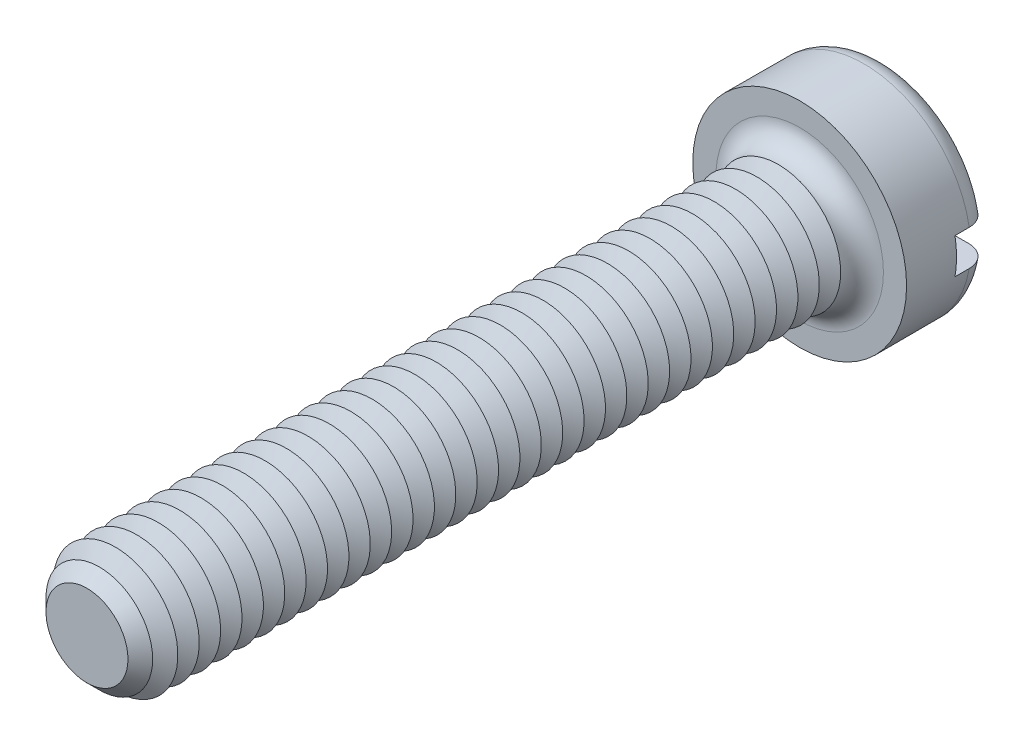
ISO-10303-21;
HEADER;
FILE_DESCRIPTION(('STEP AP214'),'2;1');
FILE_NAME('part.step','',(''),(''),'','','');
FILE_SCHEMA(('AUTOMOTIVE_DESIGN { 1 0 10303 214 1 1 1 1 }'));
ENDSEC;
DATA;
#1=APPLICATION_CONTEXT('core data for automotive mechanical design processes');
#2=APPLICATION_PROTOCOL_DEFINITION('international standard','automotive_design',2000,#1);
#3=PRODUCT_CONTEXT('',#1,'mechanical');
#4=PRODUCT('Part','Part','',(#3));
#5=PRODUCT_RELATED_PRODUCT_CATEGORY('part','',(#4));
#6=PRODUCT_DEFINITION_FORMATION('','',#4);
#7=PRODUCT_DEFINITION_CONTEXT('part definition',#1,'design');
#8=PRODUCT_DEFINITION('design','',#6,#7);
#9=PRODUCT_DEFINITION_SHAPE('','',#8);
#10=(LENGTH_UNIT() NAMED_UNIT(*) SI_UNIT(.MILLI.,.METRE.));
#11=(NAMED_UNIT(*) PLANE_ANGLE_UNIT() SI_UNIT($,.RADIAN.));
#12=(NAMED_UNIT(*) SI_UNIT($,.STERADIAN.) SOLID_ANGLE_UNIT());
#13=UNCERTAINTY_MEASURE_WITH_UNIT(LENGTH_MEASURE(1.E-05),#10,'distance_accuracy_value','');
#14=(GEOMETRIC_REPRESENTATION_CONTEXT(3) GLOBAL_UNCERTAINTY_ASSIGNED_CONTEXT((#13)) GLOBAL_UNIT_ASSIGNED_CONTEXT((#10,
#11,#12)) REPRESENTATION_CONTEXT('',''));
#15=CARTESIAN_POINT('',(0.,0.,0.));
#16=DIRECTION('',(0.,0.,1.));
#17=DIRECTION('',(1.,0.,0.));
#18=AXIS2_PLACEMENT_3D('',#15,#16,#17);
#19=CARTESIAN_POINT('',(0.,0.,-2.4));
#20=DIRECTION('',(0.,0.,1.));
#21=DIRECTION('',(1.,0.,0.));
#22=AXIS2_PLACEMENT_3D('',#19,#20,#21);
#23=PLANE('',#22);
#24=CARTESIAN_POINT('',(0.,0.,-2.4));
#25=DIRECTION('',(0.,0.,1.));
#26=DIRECTION('',(1.,0.,0.));
#27=AXIS2_PLACEMENT_3D('',#24,#25,#26);
#28=CIRCLE('',#27,2.4);
#29=CARTESIAN_POINT('',(-2.3473389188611,0.5,-2.4));
#30=VERTEX_POINT('',#29);
#31=CARTESIAN_POINT('',(2.3473389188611,0.5,-2.4));
#32=VERTEX_POINT('',#31);
#33=EDGE_CURVE('E116',#30,#32,#28,.F.);
#34=ORIENTED_EDGE('',*,*,#33,.T.);
#35=DIRECTION('',(1.,0.,0.));
#36=VECTOR('',#35,1.);
#37=CARTESIAN_POINT('',(-3.,0.5,-2.4));
#38=LINE('',#37,#36);
#39=EDGE_CURVE('E111',#30,#32,#38,.T.);
#40=ORIENTED_EDGE('',*,*,#39,.F.);
#41=EDGE_LOOP('',(#34,#40));
#42=FACE_BOUND('',#41,.T.);
#43=ADVANCED_FACE('F39',(#42),#23,.F.);
#44=CARTESIAN_POINT('',(0.,0.,-1.8));
#45=DIRECTION('',(0.,0.,1.));
#46=DIRECTION('',(1.,0.,0.));
#47=AXIS2_PLACEMENT_3D('',#44,#45,#46);
#48=TOROIDAL_SURFACE('',#47,2.4,0.6);
#49=CARTESIAN_POINT('',(-2.85761641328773,0.5,-2.13010535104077));
#50=CARTESIAN_POINT('',(-2.83871556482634,0.5,-2.1583605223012));
#51=CARTESIAN_POINT('',(-2.81738546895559,0.5,-2.18502342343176));
#52=CARTESIAN_POINT('',(-2.7705148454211,0.5,-2.23439244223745));
#53=CARTESIAN_POINT('',(-2.74496859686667,0.5,-2.25709309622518));
#54=CARTESIAN_POINT('',(-2.6904684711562,0.5,-2.29787524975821));
#55=CARTESIAN_POINT('',(-2.66151863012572,0.5,-2.3159621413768));
#56=CARTESIAN_POINT('',(-2.60103287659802,0.5,-2.34708203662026));
#57=CARTESIAN_POINT('',(-2.56949759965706,0.5,-2.36011627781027));
#58=CARTESIAN_POINT('',(-2.50430694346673,0.5,-2.38095952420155));
#59=CARTESIAN_POINT('',(-2.47062984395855,0.5,-2.38870056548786));
#60=CARTESIAN_POINT('',(-2.40245905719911,0.5,-2.39852415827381));
#61=CARTESIAN_POINT('',(-2.36796525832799,0.5,-2.40060593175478));
#62=CARTESIAN_POINT('',(-2.29850850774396,0.5,-2.39907718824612));
#63=CARTESIAN_POINT('',(-2.2635477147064,0.5,-2.3953679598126));
#64=CARTESIAN_POINT('',(-2.19472542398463,0.5,-2.38219781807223));
#65=CARTESIAN_POINT('',(-2.16086402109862,0.5,-2.37273641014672));
#66=CARTESIAN_POINT('',(-2.09483473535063,0.5,-2.3481926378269));
#67=CARTESIAN_POINT('',(-2.06268841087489,0.5,-2.3330521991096));
#68=CARTESIAN_POINT('',(-2.00140871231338,0.5,-2.29756210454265));
#69=CARTESIAN_POINT('',(-1.97227539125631,0.5,-2.27721235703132));
#70=CARTESIAN_POINT('',(-1.91805676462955,0.5,-2.23196210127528));
#71=CARTESIAN_POINT('',(-1.89294995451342,0.5,-2.20708739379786));
#72=CARTESIAN_POINT('',(-1.84740424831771,0.5,-2.1533758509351));
#73=CARTESIAN_POINT('',(-1.82696468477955,0.5,-2.12453958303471));
#74=CARTESIAN_POINT('',(-1.7919439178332,0.5,-2.06452274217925));
#75=CARTESIAN_POINT('',(-1.7772221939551,0.5,-2.03342424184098));
#76=CARTESIAN_POINT('',(-1.75343025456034,0.5,-1.96913621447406));
#77=CARTESIAN_POINT('',(-1.74435859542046,0.5,-1.93594722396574));
#78=CARTESIAN_POINT('',(-1.73243855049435,0.5,-1.86969199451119));
#79=CARTESIAN_POINT('',(-1.72938008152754,0.5,-1.83666346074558));
#80=CARTESIAN_POINT('',(-1.72896592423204,0.5,-1.77057287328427));
#81=CARTESIAN_POINT('',(-1.73160950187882,0.5,-1.73751082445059));
#82=CARTESIAN_POINT('',(-1.7423966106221,0.5,-1.67291835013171));
#83=CARTESIAN_POINT('',(-1.75043952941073,0.5,-1.64137102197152));
#84=CARTESIAN_POINT('',(-1.77163396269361,0.5,-1.58004446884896));
#85=CARTESIAN_POINT('',(-1.78478577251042,0.5,-1.55026534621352));
#86=CARTESIAN_POINT('',(-1.81598186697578,0.5,-1.49283859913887));
#87=CARTESIAN_POINT('',(-1.83409369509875,0.5,-1.46522772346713));
#88=CARTESIAN_POINT('',(-1.87455179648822,0.5,-1.41330756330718));
#89=CARTESIAN_POINT('',(-1.89689874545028,0.5,-1.38899880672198));
#90=CARTESIAN_POINT('',(-1.94600584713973,0.5,-1.34349499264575));
#91=CARTESIAN_POINT('',(-1.97289034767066,0.5,-1.32243411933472));
#92=CARTESIAN_POINT('',(-2.02972905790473,0.5,-1.28496935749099));
#93=CARTESIAN_POINT('',(-2.05968375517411,0.5,-1.26856621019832));
#94=CARTESIAN_POINT('',(-2.12276894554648,0.5,-1.24040709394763));
#95=CARTESIAN_POINT('',(-2.15596700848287,0.5,-1.22880230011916));
#96=CARTESIAN_POINT('',(-2.22383000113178,0.5,-1.21126311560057));
#97=CARTESIAN_POINT('',(-2.25849504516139,0.5,-1.20532916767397));
#98=CARTESIAN_POINT('',(-2.32870403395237,0.5,-1.1992792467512));
#99=CARTESIAN_POINT('',(-2.36425340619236,0.5,-1.19922586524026));
#100=CARTESIAN_POINT('',(-2.4348506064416,0.5,-1.2051326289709));
#101=CARTESIAN_POINT('',(-2.4698984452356,0.5,-1.21109264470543));
#102=CARTESIAN_POINT('',(-2.53821803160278,0.5,-1.22883658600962));
#103=CARTESIAN_POINT('',(-2.57150081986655,0.5,-1.24057794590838));
#104=CARTESIAN_POINT('',(-2.63557260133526,0.5,-1.2695744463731));
#105=CARTESIAN_POINT('',(-2.66636179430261,0.5,-1.28682914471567));
#106=CARTESIAN_POINT('',(-2.72402406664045,0.5,-1.32606063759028));
#107=CARTESIAN_POINT('',(-2.75095352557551,0.5,-1.34795455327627));
#108=CARTESIAN_POINT('',(-2.80067182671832,0.5,-1.39602603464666));
#109=CARTESIAN_POINT('',(-2.82346106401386,0.5,-1.42220319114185));
#110=CARTESIAN_POINT('',(-2.86383281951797,0.5,-1.47760238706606));
#111=CARTESIAN_POINT('',(-2.88149947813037,0.5,-1.50676312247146));
#112=CARTESIAN_POINT('',(-2.91160874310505,0.5,-1.56766595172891));
#113=CARTESIAN_POINT('',(-2.92405198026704,0.5,-1.59940773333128));
#114=CARTESIAN_POINT('',(-2.94319943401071,0.5,-1.66411282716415));
#115=CARTESIAN_POINT('',(-2.94997843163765,0.5,-1.69705402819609));
#116=CARTESIAN_POINT('',(-2.95787009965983,0.5,-1.7636173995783));
#117=CARTESIAN_POINT('',(-2.95898157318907,0.5,-1.79723971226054));
#118=CARTESIAN_POINT('',(-2.95551354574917,0.5,-1.86397776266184));
#119=CARTESIAN_POINT('',(-2.95096897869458,0.5,-1.89709534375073));
#120=CARTESIAN_POINT('',(-2.93638731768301,0.5,-1.96206785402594));
#121=CARTESIAN_POINT('',(-2.92635713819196,0.5,-1.99392431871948));
#122=CARTESIAN_POINT('',(-2.90618743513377,0.5,-2.04315073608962));
#123=CARTESIAN_POINT('',(-2.89769874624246,0.5,-2.06121519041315));
#124=CARTESIAN_POINT('',(-2.87895753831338,0.5,-2.096404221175));
#125=CARTESIAN_POINT('',(-2.86870503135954,0.5,-2.11352880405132));
#126=CARTESIAN_POINT('',(-2.85761641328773,0.5,-2.13010535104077));
#127=B_SPLINE_CURVE_WITH_KNOTS('',3,(#49,#50,#51,#52,#53,#54,#55,#56,#57,#58,#59,#60,#61,#62,
#63,#64,#65,#66,#67,#68,#69,#70,#71,#72,#73,#74,#75,#76,#77,#78,#79,#80,#81,#82,#83,#84,#85,#86,
#87,#88,#89,#90,#91,#92,#93,#94,#95,#96,#97,#98,#99,#100,#101,#102,#103,#104,#105,#106,#107,
#108,#109,#110,#111,#112,#113,#114,#115,#116,#117,#118,#119,#120,#121,#122,#123,#124,#125,#126),
.UNSPECIFIED.,.T.,.F.,(4,2,2,2,2,2,2,2,2,2,2,2,2,2,2,2,2,2,2,2,2,2,2,2,2,2,2,2,2,2,2,2,2,2,2,2,
2,2,4),(0.,0.101907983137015,0.203955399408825,0.305883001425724,0.407785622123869,
0.510973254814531,0.614175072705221,0.719155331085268,0.824144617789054,0.930238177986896,
1.03633360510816,1.14184204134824,1.24733537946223,1.35004136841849,1.45272110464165,
1.5517448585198,1.65075586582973,1.74797128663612,1.84519232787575,1.9438094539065,
2.0424423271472,2.14443321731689,2.24644032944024,2.35145317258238,2.45647421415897,
2.56261297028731,2.66874944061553,2.77411589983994,2.87947390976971,2.98308820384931,
3.08669260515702,3.18848388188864,3.29026286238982,3.39067588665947,3.49111011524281,
3.59092708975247,3.69061853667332,3.75040561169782,3.81019227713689),.UNSPECIFIED.);
#128=CARTESIAN_POINT('',(-2.95803989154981,0.5,-1.8));
#129=VERTEX_POINT('',#128);
#130=EDGE_CURVE('E441',#129,#30,#127,.T.);
#131=ORIENTED_EDGE('',*,*,#130,.F.);
#132=CARTESIAN_POINT('',(0.,0.,-1.8));
#133=DIRECTION('',(0.,0.,1.));
#134=DIRECTION('',(1.,0.,0.));
#135=AXIS2_PLACEMENT_3D('',#132,#133,#134);
#136=CIRCLE('',#135,3.);
#137=CARTESIAN_POINT('',(2.95803989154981,0.5,-1.8));
#138=VERTEX_POINT('',#137);
#139=EDGE_CURVE('E125',#138,#129,#136,.T.);
#140=ORIENTED_EDGE('',*,*,#139,.F.);
#141=CARTESIAN_POINT('',(1.78664846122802,0.5,-2.05158390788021));
#142=CARTESIAN_POINT('',(1.80142751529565,0.5,-2.08239430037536));
#143=CARTESIAN_POINT('',(1.81889355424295,0.5,-2.111949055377));
#144=CARTESIAN_POINT('',(1.8585933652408,0.5,-2.16770384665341));
#145=CARTESIAN_POINT('',(1.88083491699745,0.5,-2.19389829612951));
#146=CARTESIAN_POINT('',(1.92931942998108,0.5,-2.24217519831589));
#147=CARTESIAN_POINT('',(1.95555471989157,0.5,-2.26426535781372));
#148=CARTESIAN_POINT('',(2.01127789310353,0.5,-2.30384045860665));
#149=CARTESIAN_POINT('',(2.04076488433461,0.5,-2.32132665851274));
#150=CARTESIAN_POINT('',(2.10290022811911,0.5,-2.3516259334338));
#151=CARTESIAN_POINT('',(2.13560600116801,0.5,-2.3643213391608));
#152=CARTESIAN_POINT('',(2.20267136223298,0.5,-2.38412242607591));
#153=CARTESIAN_POINT('',(2.23703118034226,0.5,-2.3912273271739));
#154=CARTESIAN_POINT('',(2.30690186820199,0.5,-2.39969404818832));
#155=CARTESIAN_POINT('',(2.34242185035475,0.5,-2.40098100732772));
#156=CARTESIAN_POINT('',(2.41317063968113,0.5,-2.39753827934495));
#157=CARTESIAN_POINT('',(2.44839945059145,0.5,-2.39280866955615));
#158=CARTESIAN_POINT('',(2.51734146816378,0.5,-2.37746773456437));
#159=CARTESIAN_POINT('',(2.55106223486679,0.5,-2.3668904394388));
#160=CARTESIAN_POINT('',(2.61620389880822,0.5,-2.34013333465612));
#161=CARTESIAN_POINT('',(2.64762498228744,0.5,-2.32395397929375));
#162=CARTESIAN_POINT('',(2.70673284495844,0.5,-2.28672393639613));
#163=CARTESIAN_POINT('',(2.73447138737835,0.5,-2.26575544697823));
#164=CARTESIAN_POINT('',(2.78595339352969,0.5,-2.21938197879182));
#165=CARTESIAN_POINT('',(2.80969724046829,0.5,-2.19397742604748));
#166=CARTESIAN_POINT('',(2.85207235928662,0.5,-2.13993965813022));
#167=CARTESIAN_POINT('',(2.87078674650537,0.5,-2.11137160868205));
#168=CARTESIAN_POINT('',(2.90307455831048,0.5,-2.05146448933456));
#169=CARTESIAN_POINT('',(2.91664841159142,0.5,-2.02012565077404));
#170=CARTESIAN_POINT('',(2.93808283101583,0.5,-1.95603682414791));
#171=CARTESIAN_POINT('',(2.94602016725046,0.5,-1.92331249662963));
#172=CARTESIAN_POINT('',(2.95624273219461,0.5,-1.85699296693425));
#173=CARTESIAN_POINT('',(2.95852824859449,0.5,-1.82339780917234));
#174=CARTESIAN_POINT('',(2.95738171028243,0.5,-1.75655451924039));
#175=CARTESIAN_POINT('',(2.95399174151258,0.5,-1.72330565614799));
#176=CARTESIAN_POINT('',(2.94167749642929,0.5,-1.65784996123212));
#177=CARTESIAN_POINT('',(2.93275329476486,0.5,-1.62564311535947));
#178=CARTESIAN_POINT('',(2.90963870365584,0.5,-1.56317641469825));
#179=CARTESIAN_POINT('',(2.89544787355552,0.5,-1.53291672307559));
#180=CARTESIAN_POINT('',(2.86222325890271,0.5,-1.47518589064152));
#181=CARTESIAN_POINT('',(2.84318935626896,0.5,-1.44771481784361));
#182=CARTESIAN_POINT('',(2.80067851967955,0.5,-1.39611362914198));
#183=CARTESIAN_POINT('',(2.77716960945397,0.5,-1.37200986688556));
#184=CARTESIAN_POINT('',(2.72648704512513,0.5,-1.3280274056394));
#185=CARTESIAN_POINT('',(2.69931317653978,0.5,-1.3081489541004));
#186=CARTESIAN_POINT('',(2.64167967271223,0.5,-1.27288334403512));
#187=CARTESIAN_POINT('',(2.61118015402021,0.5,-1.25756138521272));
#188=CARTESIAN_POINT('',(2.54807315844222,0.5,-1.2321564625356));
#189=CARTESIAN_POINT('',(2.51546550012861,0.5,-1.22207395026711));
#190=CARTESIAN_POINT('',(2.44846246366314,0.5,-1.20724783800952));
#191=CARTESIAN_POINT('',(2.41404584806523,0.5,-1.2026002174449));
#192=CARTESIAN_POINT('',(2.34491756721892,0.5,-1.19904907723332));
#193=CARTESIAN_POINT('',(2.3102058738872,0.5,-1.20014611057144));
#194=CARTESIAN_POINT('',(2.24087507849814,0.5,-1.20808958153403));
#195=CARTESIAN_POINT('',(2.20626660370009,0.5,-1.21502895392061));
#196=CARTESIAN_POINT('',(2.13868705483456,0.5,-1.23457616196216));
#197=CARTESIAN_POINT('',(2.10571611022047,0.5,-1.24718444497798));
#198=CARTESIAN_POINT('',(2.04212010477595,0.5,-1.2778419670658));
#199=CARTESIAN_POINT('',(2.0115131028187,0.5,-1.29592871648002));
#200=CARTESIAN_POINT('',(1.95381117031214,0.5,-1.33703838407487));
#201=CARTESIAN_POINT('',(1.92671618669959,0.5,-1.36006122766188));
#202=CARTESIAN_POINT('',(1.8771749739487,0.5,-1.41014760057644));
#203=CARTESIAN_POINT('',(1.85467966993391,0.5,-1.43716252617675));
#204=CARTESIAN_POINT('',(1.8147167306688,0.5,-1.49468601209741));
#205=CARTESIAN_POINT('',(1.79724791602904,0.5,-1.52519375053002));
#206=CARTESIAN_POINT('',(1.76843420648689,0.5,-1.58782676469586));
#207=CARTESIAN_POINT('',(1.75691546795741,0.5,-1.61987202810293));
#208=CARTESIAN_POINT('',(1.73963101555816,0.5,-1.68548715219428));
#209=CARTESIAN_POINT('',(1.73386545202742,0.5,-1.71905705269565));
#210=CARTESIAN_POINT('',(1.72840927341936,0.5,-1.78556262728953));
#211=CARTESIAN_POINT('',(1.72852416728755,0.5,-1.8184825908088));
#212=CARTESIAN_POINT('',(1.73434422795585,0.5,-1.88379362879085));
#213=CARTESIAN_POINT('',(1.74004181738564,0.5,-1.91618535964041));
#214=CARTESIAN_POINT('',(1.75312909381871,0.5,-1.96568884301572));
#215=CARTESIAN_POINT('',(1.75869685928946,0.5,-1.98330302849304));
#216=CARTESIAN_POINT('',(1.77146455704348,0.5,-2.01792824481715));
#217=CARTESIAN_POINT('',(1.7786644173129,0.5,-2.03493930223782));
#218=CARTESIAN_POINT('',(1.78664846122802,0.5,-2.05158390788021));
#219=B_SPLINE_CURVE_WITH_KNOTS('',3,(#141,#142,#143,#144,#145,#146,#147,#148,#149,#150,#151,
#152,#153,#154,#155,#156,#157,#158,#159,#160,#161,#162,#163,#164,#165,#166,#167,#168,#169,#170,
#171,#172,#173,#174,#175,#176,#177,#178,#179,#180,#181,#182,#183,#184,#185,#186,#187,#188,#189,
#190,#191,#192,#193,#194,#195,#196,#197,#198,#199,#200,#201,#202,#203,#204,#205,#206,#207,#208,
#209,#210,#211,#212,#213,#214,#215,#216,#217,#218),.UNSPECIFIED.,.T.,.F.,(4,2,2,2,2,2,2,2,2,2,2,
2,2,2,2,2,2,2,2,2,2,2,2,2,2,2,2,2,2,2,2,2,2,2,2,2,2,2,4),(0.,0.10244464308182,0.205057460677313,
0.307475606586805,0.409865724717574,0.514628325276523,0.619405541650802,0.72552718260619,
0.831647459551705,0.937156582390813,1.04265715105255,1.1464674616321,1.25026780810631,
1.3522293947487,1.45418247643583,1.55471883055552,1.6552500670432,1.75503912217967,
1.8548268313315,1.95462289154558,2.05442138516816,2.15496174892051,2.25550799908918,
2.35743049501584,2.45936177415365,2.56306719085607,2.66678259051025,2.77217967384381,
2.87758507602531,2.98372914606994,3.08987161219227,3.19481457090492,3.29973288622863,
3.40138228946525,3.50303434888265,3.60132659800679,3.69948562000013,3.75483142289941,
3.8101747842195),.UNSPECIFIED.);
#220=EDGE_CURVE('E443',#32,#138,#219,.T.);
#221=ORIENTED_EDGE('',*,*,#220,.F.);
#222=ORIENTED_EDGE('',*,*,#33,.F.);
#223=EDGE_LOOP('',(#131,#140,#221,#222));
#224=FACE_BOUND('',#223,.T.);
#225=ADVANCED_FACE('F425',(#224),#48,.T.);
#226=CARTESIAN_POINT('',(0.,0.,-2.4));
#227=DIRECTION('',(0.,0.,1.));
#228=DIRECTION('',(1.,0.,0.));
#229=AXIS2_PLACEMENT_3D('',#226,#227,#228);
#230=CYLINDRICAL_SURFACE('',#229,3.);
#231=DIRECTION('',(0.,0.,1.));
#232=VECTOR('',#231,1.);
#233=CARTESIAN_POINT('',(2.95803989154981,0.5,-2.4));
#234=LINE('',#233,#232);
#235=CARTESIAN_POINT('',(2.95803989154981,0.5,-1.4));
#236=VERTEX_POINT('',#235);
#237=EDGE_CURVE('E457',#138,#236,#234,.T.);
#238=ORIENTED_EDGE('',*,*,#237,.F.);
#239=ORIENTED_EDGE('',*,*,#139,.T.);
#240=DIRECTION('',(0.,0.,1.));
#241=VECTOR('',#240,1.);
#242=CARTESIAN_POINT('',(-2.95803989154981,0.5,-2.4));
#243=LINE('',#242,#241);
#244=CARTESIAN_POINT('',(-2.95803989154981,0.5,-1.4));
#245=VERTEX_POINT('',#244);
#246=EDGE_CURVE('E63',#245,#129,#243,.F.);
#247=ORIENTED_EDGE('',*,*,#246,.F.);
#248=CARTESIAN_POINT('',(0.,0.,-1.4));
#249=DIRECTION('',(0.,0.,-1.));
#250=DIRECTION('',(-1.,0.,0.));
#251=AXIS2_PLACEMENT_3D('',#248,#249,#250);
#252=CIRCLE('',#251,3.);
#253=CARTESIAN_POINT('',(-2.95803989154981,-0.5,-1.4));
#254=VERTEX_POINT('',#253);
#255=EDGE_CURVE('E43',#245,#254,#252,.F.);
#256=ORIENTED_EDGE('',*,*,#255,.T.);
#257=DIRECTION('',(0.,0.,1.));
#258=VECTOR('',#257,1.);
#259=CARTESIAN_POINT('',(-2.95803989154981,-0.5,-2.4));
#260=LINE('',#259,#258);
#261=CARTESIAN_POINT('',(-2.9580398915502,-0.5,-1.79999999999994));
#262=VERTEX_POINT('',#261);
#263=EDGE_CURVE('E454',#262,#254,#260,.T.);
#264=ORIENTED_EDGE('',*,*,#263,.F.);
#265=CARTESIAN_POINT('',(2.95803989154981,-0.5,-1.8));
#266=VERTEX_POINT('',#265);
#267=EDGE_CURVE('E127',#262,#266,#136,.T.);
#268=ORIENTED_EDGE('',*,*,#267,.T.);
#269=DIRECTION('',(0.,0.,1.));
#270=VECTOR('',#269,1.);
#271=CARTESIAN_POINT('',(2.95803989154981,-0.5,-2.4));
#272=LINE('',#271,#270);
#273=CARTESIAN_POINT('',(2.95803989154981,-0.5,-1.4));
#274=VERTEX_POINT('',#273);
#275=EDGE_CURVE('E55',#274,#266,#272,.F.);
#276=ORIENTED_EDGE('',*,*,#275,.F.);
#277=EDGE_CURVE('E11',#274,#236,#252,.F.);
#278=ORIENTED_EDGE('',*,*,#277,.T.);
#279=EDGE_LOOP('',(#238,#239,#247,#256,#264,#268,#276,#278));
#280=FACE_BOUND('',#279,.T.);
#281=CARTESIAN_POINT('',(0.,0.,0.));
#282=DIRECTION('',(0.,0.,1.));
#283=DIRECTION('',(1.,0.,0.));
#284=AXIS2_PLACEMENT_3D('',#281,#282,#283);
#285=CIRCLE('',#284,3.);
#286=CARTESIAN_POINT('',(3.,0.,0.));
#287=VERTEX_POINT('',#286);
#288=EDGE_CURVE('E460',#287,#287,#285,.T.);
#289=ORIENTED_EDGE('',*,*,#288,.F.);
#290=EDGE_LOOP('',(#289));
#291=FACE_BOUND('',#290,.T.);
#292=ADVANCED_FACE('F421',(#280,#291),#230,.T.);
#293=CARTESIAN_POINT('',(2.3473389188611,-0.5,-2.4));
#294=VERTEX_POINT('',#293);
#295=CARTESIAN_POINT('',(-2.3473389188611,-0.5,-2.4));
#296=VERTEX_POINT('',#295);
#297=EDGE_CURVE('E109',#294,#296,#28,.F.);
#298=ORIENTED_EDGE('',*,*,#297,.T.);
#299=DIRECTION('',(-1.,0.,0.));
#300=VECTOR('',#299,1.);
#301=CARTESIAN_POINT('',(-3.,-0.5,-2.4));
#302=LINE('',#301,#300);
#303=EDGE_CURVE('E96',#294,#296,#302,.T.);
#304=ORIENTED_EDGE('',*,*,#303,.F.);
#305=EDGE_LOOP('',(#298,#304));
#306=FACE_BOUND('',#305,.T.);
#307=ADVANCED_FACE('F108',(#306),#23,.F.);
#308=CARTESIAN_POINT('',(0.,0.,0.));
#309=DIRECTION('',(0.,0.,1.));
#310=DIRECTION('',(1.,0.,0.));
#311=AXIS2_PLACEMENT_3D('',#308,#309,#310);
#312=PLANE('',#311);
#313=CARTESIAN_POINT('',(0.,0.,0.));
#314=DIRECTION('',(0.,0.,1.));
#315=DIRECTION('',(1.,0.,0.));
#316=AXIS2_PLACEMENT_3D('',#313,#314,#315);
#317=CIRCLE('',#316,2.35);
#318=CARTESIAN_POINT('',(2.35,0.,0.));
#319=VERTEX_POINT('',#318);
#320=EDGE_CURVE('E115',#319,#319,#317,.F.);
#321=ORIENTED_EDGE('',*,*,#320,.T.);
#322=EDGE_LOOP('',(#321));
#323=FACE_BOUND('',#322,.T.);
#324=ORIENTED_EDGE('',*,*,#288,.T.);
#325=EDGE_LOOP('',(#324));
#326=FACE_BOUND('',#325,.T.);
#327=ADVANCED_FACE('F420',(#323,#326),#312,.T.);
#328=CARTESIAN_POINT('',(-2.85761641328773,-0.5,-2.13010535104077));
#329=CARTESIAN_POINT('',(-2.87617085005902,-0.5,-2.10236255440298));
#330=CARTESIAN_POINT('',(-2.89241094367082,-0.5,-2.07304478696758));
#331=CARTESIAN_POINT('',(-2.91975805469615,-0.5,-2.01207835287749));
#332=CARTESIAN_POINT('',(-2.93085958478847,-0.5,-1.98042723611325));
#333=CARTESIAN_POINT('',(-2.94757590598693,-0.5,-1.91570997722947));
#334=CARTESIAN_POINT('',(-2.95319165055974,-0.5,-1.88264408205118));
#335=CARTESIAN_POINT('',(-2.95876526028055,-0.5,-1.81604673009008));
#336=CARTESIAN_POINT('',(-2.95872441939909,-0.5,-1.78251538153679));
#337=CARTESIAN_POINT('',(-2.95300126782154,-0.5,-1.71606888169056));
#338=CARTESIAN_POINT('',(-2.94734076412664,-0.5,-1.68315184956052));
#339=CARTESIAN_POINT('',(-2.93058183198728,-0.5,-1.61873244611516));
#340=CARTESIAN_POINT('',(-2.91948325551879,-0.5,-1.58723011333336));
#341=CARTESIAN_POINT('',(-2.89215903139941,-0.5,-1.52647404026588));
#342=CARTESIAN_POINT('',(-2.87592518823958,-0.5,-1.49722398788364));
#343=CARTESIAN_POINT('',(-2.83881787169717,-0.5,-1.44183365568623));
#344=CARTESIAN_POINT('',(-2.81794425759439,-0.5,-1.41569347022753));
#345=CARTESIAN_POINT('',(-2.77196258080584,-0.5,-1.36700890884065));
#346=CARTESIAN_POINT('',(-2.74681874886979,-0.5,-1.34449832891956));
#347=CARTESIAN_POINT('',(-2.69315595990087,-0.5,-1.30394571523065));
#348=CARTESIAN_POINT('',(-2.66463678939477,-0.5,-1.28590396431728));
#349=CARTESIAN_POINT('',(-2.6045885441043,-0.5,-1.25451133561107));
#350=CARTESIAN_POINT('',(-2.573021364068,-0.5,-1.24123336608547));
#351=CARTESIAN_POINT('',(-2.50813094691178,-0.5,-1.22006271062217));
#352=CARTESIAN_POINT('',(-2.47480755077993,-0.5,-1.21217051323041));
#353=CARTESIAN_POINT('',(-2.40672281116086,-0.5,-1.20185046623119));
#354=CARTESIAN_POINT('',(-2.37194646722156,-0.5,-1.19952155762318));
#355=CARTESIAN_POINT('',(-2.30248663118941,-0.5,-1.20064178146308));
#356=CARTESIAN_POINT('',(-2.26780314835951,-0.5,-1.20409147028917));
#357=CARTESIAN_POINT('',(-2.19896003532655,-0.5,-1.21674803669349));
#358=CARTESIAN_POINT('',(-2.16481620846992,-0.5,-1.22604100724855));
#359=CARTESIAN_POINT('',(-2.09855902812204,-0.5,-1.25020237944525));
#360=CARTESIAN_POINT('',(-2.0664458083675,-0.5,-1.2650711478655));
#361=CARTESIAN_POINT('',(-2.00504979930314,-0.5,-1.3000633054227));
#362=CARTESIAN_POINT('',(-1.97577870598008,-0.5,-1.32020724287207));
#363=CARTESIAN_POINT('',(-1.92109882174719,-0.5,-1.36519538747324));
#364=CARTESIAN_POINT('',(-1.89568984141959,-0.5,-1.39003936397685));
#365=CARTESIAN_POINT('',(-1.84992350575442,-0.5,-1.44333696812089));
#366=CARTESIAN_POINT('',(-1.82949305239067,-0.5,-1.47172774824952));
#367=CARTESIAN_POINT('',(-1.79388305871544,-0.5,-1.53163225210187));
#368=CARTESIAN_POINT('',(-1.77870235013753,-0.5,-1.56314527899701));
#369=CARTESIAN_POINT('',(-1.7545759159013,-0.5,-1.62726698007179));
#370=CARTESIAN_POINT('',(-1.74543784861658,-0.5,-1.65980327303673));
#371=CARTESIAN_POINT('',(-1.73294830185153,-0.5,-1.72596654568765));
#372=CARTESIAN_POINT('',(-1.72959555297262,-0.5,-1.7595932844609));
#373=CARTESIAN_POINT('',(-1.72881879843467,-0.5,-1.82588200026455));
#374=CARTESIAN_POINT('',(-1.73121660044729,-0.5,-1.85854202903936));
#375=CARTESIAN_POINT('',(-1.74148022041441,-0.5,-1.9229888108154));
#376=CARTESIAN_POINT('',(-1.74934586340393,-0.5,-1.95477559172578));
#377=CARTESIAN_POINT('',(-1.77023164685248,-0.5,-2.01650910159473));
#378=CARTESIAN_POINT('',(-1.78323812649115,-0.5,-2.04646046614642));
#379=CARTESIAN_POINT('',(-1.81396733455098,-0.5,-2.10383471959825));
#380=CARTESIAN_POINT('',(-1.83169061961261,-0.5,-2.13125730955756));
#381=CARTESIAN_POINT('',(-1.87183626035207,-0.5,-2.18359240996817));
#382=CARTESIAN_POINT('',(-1.89437158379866,-0.5,-2.20841820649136));
#383=CARTESIAN_POINT('',(-1.9431646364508,-0.5,-2.25409214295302));
#384=CARTESIAN_POINT('',(-1.96942301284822,-0.5,-2.27493958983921));
#385=CARTESIAN_POINT('',(-2.025898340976,-0.5,-2.31281042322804));
#386=CARTESIAN_POINT('',(-2.05622082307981,-0.5,-2.32967654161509));
#387=CARTESIAN_POINT('',(-2.11922391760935,-0.5,-2.35820255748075));
#388=CARTESIAN_POINT('',(-2.15190483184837,-0.5,-2.3698617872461));
#389=CARTESIAN_POINT('',(-2.21944675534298,-0.5,-2.38785911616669));
#390=CARTESIAN_POINT('',(-2.25433929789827,-0.5,-2.39407914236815));
#391=CARTESIAN_POINT('',(-2.32467357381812,-0.5,-2.40058243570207));
#392=CARTESIAN_POINT('',(-2.36011530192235,-0.5,-2.40086575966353));
#393=CARTESIAN_POINT('',(-2.43058129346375,-0.5,-2.39545061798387));
#394=CARTESIAN_POINT('',(-2.46560504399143,-0.5,-2.38974544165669));
#395=CARTESIAN_POINT('',(-2.53418188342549,-0.5,-2.37245602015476));
#396=CARTESIAN_POINT('',(-2.56773468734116,-0.5,-2.36087064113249));
#397=CARTESIAN_POINT('',(-2.63195003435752,-0.5,-2.33229154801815));
#398=CARTESIAN_POINT('',(-2.66264330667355,-0.5,-2.31536681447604));
#399=CARTESIAN_POINT('',(-2.72065333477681,-0.5,-2.2765252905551));
#400=CARTESIAN_POINT('',(-2.7479744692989,-0.5,-2.25461508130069));
#401=CARTESIAN_POINT('',(-2.78903570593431,-0.5,-2.21539504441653));
#402=CARTESIAN_POINT('',(-2.80405150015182,-0.5,-2.19939833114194));
#403=CARTESIAN_POINT('',(-2.83224965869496,-0.5,-2.16586257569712));
#404=CARTESIAN_POINT('',(-2.84543204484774,-0.5,-2.14832355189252));
#405=CARTESIAN_POINT('',(-2.85761641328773,-0.5,-2.13010535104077));
#406=B_SPLINE_CURVE_WITH_KNOTS('',3,(#328,#329,#330,#331,#332,#333,#334,#335,#336,#337,#338,
#339,#340,#341,#342,#343,#344,#345,#346,#347,#348,#349,#350,#351,#352,#353,#354,#355,#356,#357,
#358,#359,#360,#361,#362,#363,#364,#365,#366,#367,#368,#369,#370,#371,#372,#373,#374,#375,#376,
#377,#378,#379,#380,#381,#382,#383,#384,#385,#386,#387,#388,#389,#390,#391,#392,#393,#394,#395,
#396,#397,#398,#399,#400,#401,#402,#403,#404,#405),.UNSPECIFIED.,.T.,.F.,(4,2,2,2,2,2,2,2,2,2,2,
2,2,2,2,2,2,2,2,2,2,2,2,2,2,2,2,2,2,2,2,2,2,2,2,2,2,2,4),(0.,0.100047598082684,
0.200201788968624,0.300338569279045,0.400452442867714,0.500179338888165,0.599908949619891,
0.699798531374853,0.799691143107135,0.900465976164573,1.00124718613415,1.10351091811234,
1.20578392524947,1.30986270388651,1.41395150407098,1.51961105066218,1.62527754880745,
1.73136193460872,1.83744111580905,1.94185359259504,2.04624281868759,2.1471248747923,
2.24798479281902,2.34575994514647,2.44353196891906,2.541045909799,2.63857136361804,
2.73870431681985,2.83885469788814,2.94247024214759,3.0460990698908,3.15192527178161,
3.25775046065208,3.36369436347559,3.46965870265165,3.57430655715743,3.67881706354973,
3.74451732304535,3.81021680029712),.UNSPECIFIED.);
#407=EDGE_CURVE('E103',#296,#262,#406,.T.);
#408=ORIENTED_EDGE('',*,*,#407,.F.);
#409=ORIENTED_EDGE('',*,*,#297,.F.);
#410=CARTESIAN_POINT('',(1.78664846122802,-0.5,-2.05158390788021));
#411=CARTESIAN_POINT('',(1.77253256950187,-0.5,-2.02214917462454));
#412=CARTESIAN_POINT('',(1.76084795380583,-0.5,-1.99152692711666));
#413=CARTESIAN_POINT('',(1.74276267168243,-0.5,-1.92873811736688));
#414=CARTESIAN_POINT('',(1.73636622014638,-0.5,-1.89657034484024));
#415=CARTESIAN_POINT('',(1.72910271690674,-0.5,-1.83160458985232));
#416=CARTESIAN_POINT('',(1.72823699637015,-0.5,-1.79880645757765));
#417=CARTESIAN_POINT('',(1.73207277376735,-0.5,-1.73354460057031));
#418=CARTESIAN_POINT('',(1.7367732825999,-0.5,-1.70108081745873));
#419=CARTESIAN_POINT('',(1.75151033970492,-0.5,-1.63763571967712));
#420=CARTESIAN_POINT('',(1.76150868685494,-0.5,-1.60664550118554));
#421=CARTESIAN_POINT('',(1.78646773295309,-0.5,-1.54673433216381));
#422=CARTESIAN_POINT('',(1.80142897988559,-0.5,-1.51781361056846));
#423=CARTESIAN_POINT('',(1.8361687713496,-0.5,-1.46223275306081));
#424=CARTESIAN_POINT('',(1.85603637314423,-0.5,-1.43562834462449));
#425=CARTESIAN_POINT('',(1.89981598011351,-0.5,-1.38598822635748));
#426=CARTESIAN_POINT('',(1.92372865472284,-0.5,-1.3629531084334));
#427=CARTESIAN_POINT('',(1.97581791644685,-0.5,-1.32025912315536));
#428=CARTESIAN_POINT('',(2.00411431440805,-0.5,-1.30074638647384));
#429=CARTESIAN_POINT('',(2.06351340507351,-0.5,-1.26660223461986));
#430=CARTESIAN_POINT('',(2.09461651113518,-0.5,-1.2519715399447));
#431=CARTESIAN_POINT('',(2.15964055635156,-0.5,-1.22763649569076));
#432=CARTESIAN_POINT('',(2.19361437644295,-0.5,-1.21807321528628));
#433=CARTESIAN_POINT('',(2.26268197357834,-0.5,-1.20474094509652));
#434=CARTESIAN_POINT('',(2.29777581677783,-0.5,-1.20097229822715));
#435=CARTESIAN_POINT('',(2.36834397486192,-0.5,-1.19935270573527));
#436=CARTESIAN_POINT('',(2.40381924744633,-0.5,-1.20154258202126));
#437=CARTESIAN_POINT('',(2.47388621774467,-0.5,-1.211906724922));
#438=CARTESIAN_POINT('',(2.50847794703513,-0.5,-1.22008077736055));
#439=CARTESIAN_POINT('',(2.57542869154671,-0.5,-1.24211740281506));
#440=CARTESIAN_POINT('',(2.60780612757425,-0.5,-1.25592395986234));
#441=CARTESIAN_POINT('',(2.66972487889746,-0.5,-1.28886991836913));
#442=CARTESIAN_POINT('',(2.69926644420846,-0.5,-1.3080088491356));
#443=CARTESIAN_POINT('',(2.75412764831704,-0.5,-1.35072337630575));
#444=CARTESIAN_POINT('',(2.77951140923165,-0.5,-1.37421661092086));
#445=CARTESIAN_POINT('',(2.82588981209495,-0.5,-1.42519687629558));
#446=CARTESIAN_POINT('',(2.84688487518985,-0.5,-1.4526835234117));
#447=CARTESIAN_POINT('',(2.88351678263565,-0.5,-1.51036368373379));
#448=CARTESIAN_POINT('',(2.89923879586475,-0.5,-1.54050312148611));
#449=CARTESIAN_POINT('',(2.92532780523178,-0.5,-1.60301687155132));
#450=CARTESIAN_POINT('',(2.93569520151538,-0.5,-1.63539101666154));
#451=CARTESIAN_POINT('',(2.95066155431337,-0.5,-1.70102985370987));
#452=CARTESIAN_POINT('',(2.95532930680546,-0.5,-1.73427887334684));
#453=CARTESIAN_POINT('',(2.9589838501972,-0.5,-1.80108716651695));
#454=CARTESIAN_POINT('',(2.95797087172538,-0.5,-1.83464642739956));
#455=CARTESIAN_POINT('',(2.9503157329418,-0.5,-1.90093629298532));
#456=CARTESIAN_POINT('',(2.9437032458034,-0.5,-1.93367033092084));
#457=CARTESIAN_POINT('',(2.92508830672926,-0.5,-1.99756717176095));
#458=CARTESIAN_POINT('',(2.91308586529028,-0.5,-2.02872997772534));
#459=CARTESIAN_POINT('',(2.88401713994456,-0.5,-2.08868263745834));
#460=CARTESIAN_POINT('',(2.86693946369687,-0.5,-2.11746696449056));
#461=CARTESIAN_POINT('',(2.82823635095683,-0.5,-2.17179415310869));
#462=CARTESIAN_POINT('',(2.80661076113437,-0.5,-2.19733690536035));
#463=CARTESIAN_POINT('',(2.75921750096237,-0.5,-2.24472182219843));
#464=CARTESIAN_POINT('',(2.73341278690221,-0.5,-2.26652692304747));
#465=CARTESIAN_POINT('',(2.67855512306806,-0.5,-2.30557116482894));
#466=CARTESIAN_POINT('',(2.64950194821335,-0.5,-2.32280998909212));
#467=CARTESIAN_POINT('',(2.58850670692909,-0.5,-2.35251615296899));
#468=CARTESIAN_POINT('',(2.55652763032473,-0.5,-2.36490748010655));
#469=CARTESIAN_POINT('',(2.4909651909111,-0.5,-2.38424946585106));
#470=CARTESIAN_POINT('',(2.45738167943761,-0.5,-2.39119961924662));
#471=CARTESIAN_POINT('',(2.38892891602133,-0.5,-2.39958830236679));
#472=CARTESIAN_POINT('',(2.35404742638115,-0.5,-2.40092701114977));
#473=CARTESIAN_POINT('',(2.28454389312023,-0.5,-2.39781917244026));
#474=CARTESIAN_POINT('',(2.24992186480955,-0.5,-2.39337228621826));
#475=CARTESIAN_POINT('',(2.18139250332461,-0.5,-2.37872879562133));
#476=CARTESIAN_POINT('',(2.14750264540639,-0.5,-2.36845030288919));
#477=CARTESIAN_POINT('',(2.08190943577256,-0.5,-2.34236291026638));
#478=CARTESIAN_POINT('',(2.05020675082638,-0.5,-2.32655233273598));
#479=CARTESIAN_POINT('',(1.98982495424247,-0.5,-2.28976285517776));
#480=CARTESIAN_POINT('',(1.96115527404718,-0.5,-2.26876847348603));
#481=CARTESIAN_POINT('',(1.90785147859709,-0.5,-2.22220002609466));
#482=CARTESIAN_POINT('',(1.88321231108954,-0.5,-2.19663177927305));
#483=CARTESIAN_POINT('',(1.84638483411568,-0.5,-2.15106161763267));
#484=CARTESIAN_POINT('',(1.8328227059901,-0.5,-2.13215328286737));
#485=CARTESIAN_POINT('',(1.80797918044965,-0.5,-2.09289185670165));
#486=CARTESIAN_POINT('',(1.79669771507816,-0.5,-2.07253880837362));
#487=CARTESIAN_POINT('',(1.78664846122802,-0.5,-2.05158390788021));
#488=B_SPLINE_CURVE_WITH_KNOTS('',3,(#410,#411,#412,#413,#414,#415,#416,#417,#418,#419,#420,
#421,#422,#423,#424,#425,#426,#427,#428,#429,#430,#431,#432,#433,#434,#435,#436,#437,#438,#439,
#440,#441,#442,#443,#444,#445,#446,#447,#448,#449,#450,#451,#452,#453,#454,#455,#456,#457,#458,
#459,#460,#461,#462,#463,#464,#465,#466,#467,#468,#469,#470,#471,#472,#473,#474,#475,#476,#477,
#478,#479,#480,#481,#482,#483,#484,#485,#486,#487),.UNSPECIFIED.,.T.,.F.,(4,2,2,2,2,2,2,2,2,2,2,
2,2,2,2,2,2,2,2,2,2,2,2,2,2,2,2,2,2,2,2,2,2,2,2,2,2,2,4),(0.,0.0978512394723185,0.19578039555,
0.293733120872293,0.391668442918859,0.488907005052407,0.58615630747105,0.685320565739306,
0.784501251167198,0.887148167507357,0.989810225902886,1.09519726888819,1.20059054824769,
1.30670769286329,1.41282103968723,1.51790384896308,1.62297738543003,1.72623563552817,
1.82948397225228,1.93097382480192,2.03245609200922,2.13270093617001,2.23294171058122,
2.33265458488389,2.43236726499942,2.53230548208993,2.63224706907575,2.73312861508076,
2.83401715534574,2.93642973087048,3.03885181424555,3.14308833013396,3.24733094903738,
3.35307493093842,3.45885100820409,3.56494689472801,3.67090875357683,3.74057217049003,
3.81023351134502),.UNSPECIFIED.);
#489=EDGE_CURVE('E92',#266,#294,#488,.T.);
#490=ORIENTED_EDGE('',*,*,#489,.F.);
#491=ORIENTED_EDGE('',*,*,#267,.F.);
#492=EDGE_LOOP('',(#408,#409,#490,#491));
#493=FACE_BOUND('',#492,.T.);
#494=ADVANCED_FACE('F113',(#493),#48,.T.);
#495=CARTESIAN_POINT('',(0.,0.,0.6));
#496=DIRECTION('',(0.,0.,1.));
#497=DIRECTION('',(1.,0.,0.));
#498=AXIS2_PLACEMENT_3D('',#495,#496,#497);
#499=TOROIDAL_SURFACE('',#498,2.35,0.6);
#500=ORIENTED_EDGE('',*,*,#320,.F.);
#501=EDGE_LOOP('',(#500));
#502=FACE_BOUND('',#501,.T.);
#503=CARTESIAN_POINT('',(0.,0.,0.6));
#504=DIRECTION('',(0.,0.,-1.));
#505=DIRECTION('',(-1.,0.,0.));
#506=AXIS2_PLACEMENT_3D('',#503,#504,#505);
#507=CIRCLE('',#506,1.75);
#508=CARTESIAN_POINT('',(-1.75,0.,0.6));
#509=VERTEX_POINT('',#508);
#510=EDGE_CURVE('E466',#509,#509,#507,.T.);
#511=ORIENTED_EDGE('',*,*,#510,.T.);
#512=EDGE_LOOP('',(#511));
#513=FACE_BOUND('',#512,.T.);
#514=ADVANCED_FACE('F413',(#502,#513),#499,.F.);
#515=CARTESIAN_POINT('',(0.,0.,0.9));
#516=DIRECTION('',(0.,0.,-1.));
#517=DIRECTION('',(-1.,0.,0.));
#518=AXIS2_PLACEMENT_3D('',#515,#516,#517);
#519=CONICAL_SURFACE('',#518,1.23038475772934,1.0471975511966);
#520=ORIENTED_EDGE('',*,*,#510,.F.);
#521=EDGE_LOOP('',(#520));
#522=FACE_BOUND('',#521,.T.);
#523=CARTESIAN_POINT('',(0.,0.,0.9));
#524=DIRECTION('',(0.,0.,-1.));
#525=DIRECTION('',(-1.,0.,0.));
#526=AXIS2_PLACEMENT_3D('',#523,#524,#525);
#527=CIRCLE('',#526,1.23038475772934);
#528=CARTESIAN_POINT('',(-1.23038475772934,0.,0.9));
#529=VERTEX_POINT('',#528);
#530=EDGE_CURVE('E471',#529,#529,#527,.T.);
#531=ORIENTED_EDGE('',*,*,#530,.T.);
#532=EDGE_LOOP('',(#531));
#533=FACE_BOUND('',#532,.T.);
#534=ADVANCED_FACE('F409',(#522,#533),#519,.T.);
#535=CARTESIAN_POINT('',(0.,0.,1.2));
#536=DIRECTION('',(0.,0.,1.));
#537=DIRECTION('',(1.,0.,0.));
#538=AXIS2_PLACEMENT_3D('',#535,#536,#537);
#539=CONICAL_SURFACE('',#538,1.75,1.0471975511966);
#540=ORIENTED_EDGE('',*,*,#530,.F.);
#541=EDGE_LOOP('',(#540));
#542=FACE_BOUND('',#541,.T.);
#543=CARTESIAN_POINT('',(0.,0.,1.2));
#544=DIRECTION('',(0.,0.,-1.));
#545=DIRECTION('',(-1.,0.,0.));
#546=AXIS2_PLACEMENT_3D('',#543,#544,#545);
#547=CIRCLE('',#546,1.75);
#548=CARTESIAN_POINT('',(-1.75,0.,1.2));
#549=VERTEX_POINT('',#548);
#550=EDGE_CURVE('E477',#549,#549,#547,.T.);
#551=ORIENTED_EDGE('',*,*,#550,.T.);
#552=EDGE_LOOP('',(#551));
#553=FACE_BOUND('',#552,.T.);
#554=ADVANCED_FACE('F405',(#542,#553),#539,.T.);
#555=CARTESIAN_POINT('',(0.,0.,1.5));
#556=DIRECTION('',(0.,0.,-1.));
#557=DIRECTION('',(-1.,0.,0.));
#558=AXIS2_PLACEMENT_3D('',#555,#556,#557);
#559=CONICAL_SURFACE('',#558,1.23038475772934,1.0471975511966);
#560=ORIENTED_EDGE('',*,*,#550,.F.);
#561=EDGE_LOOP('',(#560));
#562=FACE_BOUND('',#561,.T.);
#563=CARTESIAN_POINT('',(0.,0.,1.5));
#564=DIRECTION('',(0.,0.,-1.));
#565=DIRECTION('',(-1.,0.,0.));
#566=AXIS2_PLACEMENT_3D('',#563,#564,#565);
#567=CIRCLE('',#566,1.23038475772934);
#568=CARTESIAN_POINT('',(-1.23038475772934,0.,1.5));
#569=VERTEX_POINT('',#568);
#570=EDGE_CURVE('E481',#569,#569,#567,.T.);
#571=ORIENTED_EDGE('',*,*,#570,.T.);
#572=EDGE_LOOP('',(#571));
#573=FACE_BOUND('',#572,.T.);
#574=ADVANCED_FACE('F401',(#562,#573),#559,.T.);
#575=CARTESIAN_POINT('',(0.,0.,1.8));
#576=DIRECTION('',(0.,0.,1.));
#577=DIRECTION('',(1.,0.,0.));
#578=AXIS2_PLACEMENT_3D('',#575,#576,#577);
#579=CONICAL_SURFACE('',#578,1.75,1.0471975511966);
#580=ORIENTED_EDGE('',*,*,#570,.F.);
#581=EDGE_LOOP('',(#580));
#582=FACE_BOUND('',#581,.T.);
#583=CARTESIAN_POINT('',(0.,0.,1.8));
#584=DIRECTION('',(0.,0.,-1.));
#585=DIRECTION('',(-1.,0.,0.));
#586=AXIS2_PLACEMENT_3D('',#583,#584,#585);
#587=CIRCLE('',#586,1.75);
#588=CARTESIAN_POINT('',(-1.75,0.,1.8));
#589=VERTEX_POINT('',#588);
#590=EDGE_CURVE('E485',#589,#589,#587,.T.);
#591=ORIENTED_EDGE('',*,*,#590,.T.);
#592=EDGE_LOOP('',(#591));
#593=FACE_BOUND('',#592,.T.);
#594=ADVANCED_FACE('F397',(#582,#593),#579,.T.);
#595=CARTESIAN_POINT('',(0.,0.,2.1));
#596=DIRECTION('',(0.,0.,-1.));
#597=DIRECTION('',(-1.,0.,0.));
#598=AXIS2_PLACEMENT_3D('',#595,#596,#597);
#599=CONICAL_SURFACE('',#598,1.23038475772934,1.0471975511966);
#600=ORIENTED_EDGE('',*,*,#590,.F.);
#601=EDGE_LOOP('',(#600));
#602=FACE_BOUND('',#601,.T.);
#603=CARTESIAN_POINT('',(0.,0.,2.1));
#604=DIRECTION('',(0.,0.,-1.));
#605=DIRECTION('',(-1.,0.,0.));
#606=AXIS2_PLACEMENT_3D('',#603,#604,#605);
#607=CIRCLE('',#606,1.23038475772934);
#608=CARTESIAN_POINT('',(-1.23038475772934,0.,2.1));
#609=VERTEX_POINT('',#608);
#610=EDGE_CURVE('E489',#609,#609,#607,.T.);
#611=ORIENTED_EDGE('',*,*,#610,.T.);
#612=EDGE_LOOP('',(#611));
#613=FACE_BOUND('',#612,.T.);
#614=ADVANCED_FACE('F393',(#602,#613),#599,.T.);
#615=CARTESIAN_POINT('',(0.,0.,2.4));
#616=DIRECTION('',(0.,0.,1.));
#617=DIRECTION('',(1.,0.,0.));
#618=AXIS2_PLACEMENT_3D('',#615,#616,#617);
#619=CONICAL_SURFACE('',#618,1.75,1.0471975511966);
#620=ORIENTED_EDGE('',*,*,#610,.F.);
#621=EDGE_LOOP('',(#620));
#622=FACE_BOUND('',#621,.T.);
#623=CARTESIAN_POINT('',(0.,0.,2.4));
#624=DIRECTION('',(0.,0.,-1.));
#625=DIRECTION('',(-1.,0.,0.));
#626=AXIS2_PLACEMENT_3D('',#623,#624,#625);
#627=CIRCLE('',#626,1.75);
#628=CARTESIAN_POINT('',(-1.75,0.,2.4));
#629=VERTEX_POINT('',#628);
#630=EDGE_CURVE('E493',#629,#629,#627,.T.);
#631=ORIENTED_EDGE('',*,*,#630,.T.);
#632=EDGE_LOOP('',(#631));
#633=FACE_BOUND('',#632,.T.);
#634=ADVANCED_FACE('F389',(#622,#633),#619,.T.);
#635=CARTESIAN_POINT('',(0.,0.,2.7));
#636=DIRECTION('',(0.,0.,-1.));
#637=DIRECTION('',(-1.,0.,0.));
#638=AXIS2_PLACEMENT_3D('',#635,#636,#637);
#639=CONICAL_SURFACE('',#638,1.23038475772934,1.0471975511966);
#640=ORIENTED_EDGE('',*,*,#630,.F.);
#641=EDGE_LOOP('',(#640));
#642=FACE_BOUND('',#641,.T.);
#643=CARTESIAN_POINT('',(0.,0.,2.7));
#644=DIRECTION('',(0.,0.,-1.));
#645=DIRECTION('',(-1.,0.,0.));
#646=AXIS2_PLACEMENT_3D('',#643,#644,#645);
#647=CIRCLE('',#646,1.23038475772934);
#648=CARTESIAN_POINT('',(-1.23038475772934,0.,2.7));
#649=VERTEX_POINT('',#648);
#650=EDGE_CURVE('E497',#649,#649,#647,.T.);
#651=ORIENTED_EDGE('',*,*,#650,.T.);
#652=EDGE_LOOP('',(#651));
#653=FACE_BOUND('',#652,.T.);
#654=ADVANCED_FACE('F385',(#642,#653),#639,.T.);
#655=CARTESIAN_POINT('',(0.,0.,3.));
#656=DIRECTION('',(0.,0.,1.));
#657=DIRECTION('',(1.,0.,0.));
#658=AXIS2_PLACEMENT_3D('',#655,#656,#657);
#659=CONICAL_SURFACE('',#658,1.75,1.0471975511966);
#660=ORIENTED_EDGE('',*,*,#650,.F.);
#661=EDGE_LOOP('',(#660));
#662=FACE_BOUND('',#661,.T.);
#663=CARTESIAN_POINT('',(0.,0.,3.));
#664=DIRECTION('',(0.,0.,-1.));
#665=DIRECTION('',(-1.,0.,0.));
#666=AXIS2_PLACEMENT_3D('',#663,#664,#665);
#667=CIRCLE('',#666,1.75);
#668=CARTESIAN_POINT('',(-1.75,0.,3.));
#669=VERTEX_POINT('',#668);
#670=EDGE_CURVE('E501',#669,#669,#667,.T.);
#671=ORIENTED_EDGE('',*,*,#670,.T.);
#672=EDGE_LOOP('',(#671));
#673=FACE_BOUND('',#672,.T.);
#674=ADVANCED_FACE('F381',(#662,#673),#659,.T.);
#675=CARTESIAN_POINT('',(0.,0.,3.3));
#676=DIRECTION('',(0.,0.,-1.));
#677=DIRECTION('',(-1.,0.,0.));
#678=AXIS2_PLACEMENT_3D('',#675,#676,#677);
#679=CONICAL_SURFACE('',#678,1.23038475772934,1.0471975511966);
#680=ORIENTED_EDGE('',*,*,#670,.F.);
#681=EDGE_LOOP('',(#680));
#682=FACE_BOUND('',#681,.T.);
#683=CARTESIAN_POINT('',(0.,0.,3.3));
#684=DIRECTION('',(0.,0.,-1.));
#685=DIRECTION('',(-1.,0.,0.));
#686=AXIS2_PLACEMENT_3D('',#683,#684,#685);
#687=CIRCLE('',#686,1.23038475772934);
#688=CARTESIAN_POINT('',(-1.23038475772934,0.,3.3));
#689=VERTEX_POINT('',#688);
#690=EDGE_CURVE('E504',#689,#689,#687,.T.);
#691=ORIENTED_EDGE('',*,*,#690,.T.);
#692=EDGE_LOOP('',(#691));
#693=FACE_BOUND('',#692,.T.);
#694=ADVANCED_FACE('F377',(#682,#693),#679,.T.);
#695=CARTESIAN_POINT('',(0.,0.,3.6));
#696=DIRECTION('',(0.,0.,1.));
#697=DIRECTION('',(1.,0.,0.));
#698=AXIS2_PLACEMENT_3D('',#695,#696,#697);
#699=CONICAL_SURFACE('',#698,1.75,1.0471975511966);
#700=ORIENTED_EDGE('',*,*,#690,.F.);
#701=EDGE_LOOP('',(#700));
#702=FACE_BOUND('',#701,.T.);
#703=CARTESIAN_POINT('',(0.,0.,3.6));
#704=DIRECTION('',(0.,0.,-1.));
#705=DIRECTION('',(-1.,0.,0.));
#706=AXIS2_PLACEMENT_3D('',#703,#704,#705);
#707=CIRCLE('',#706,1.75);
#708=CARTESIAN_POINT('',(-1.75,0.,3.6));
#709=VERTEX_POINT('',#708);
#710=EDGE_CURVE('E508',#709,#709,#707,.T.);
#711=ORIENTED_EDGE('',*,*,#710,.T.);
#712=EDGE_LOOP('',(#711));
#713=FACE_BOUND('',#712,.T.);
#714=ADVANCED_FACE('F373',(#702,#713),#699,.T.);
#715=CARTESIAN_POINT('',(0.,0.,3.9));
#716=DIRECTION('',(0.,0.,-1.));
#717=DIRECTION('',(-1.,0.,0.));
#718=AXIS2_PLACEMENT_3D('',#715,#716,#717);
#719=CONICAL_SURFACE('',#718,1.23038475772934,1.0471975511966);
#720=ORIENTED_EDGE('',*,*,#710,.F.);
#721=EDGE_LOOP('',(#720));
#722=FACE_BOUND('',#721,.T.);
#723=CARTESIAN_POINT('',(0.,0.,3.9));
#724=DIRECTION('',(0.,0.,-1.));
#725=DIRECTION('',(-1.,0.,0.));
#726=AXIS2_PLACEMENT_3D('',#723,#724,#725);
#727=CIRCLE('',#726,1.23038475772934);
#728=CARTESIAN_POINT('',(-1.23038475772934,0.,3.9));
#729=VERTEX_POINT('',#728);
#730=EDGE_CURVE('E512',#729,#729,#727,.T.);
#731=ORIENTED_EDGE('',*,*,#730,.T.);
#732=EDGE_LOOP('',(#731));
#733=FACE_BOUND('',#732,.T.);
#734=ADVANCED_FACE('F369',(#722,#733),#719,.T.);
#735=CARTESIAN_POINT('',(0.,0.,4.2));
#736=DIRECTION('',(0.,0.,1.));
#737=DIRECTION('',(1.,0.,0.));
#738=AXIS2_PLACEMENT_3D('',#735,#736,#737);
#739=CONICAL_SURFACE('',#738,1.75,1.0471975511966);
#740=ORIENTED_EDGE('',*,*,#730,.F.);
#741=EDGE_LOOP('',(#740));
#742=FACE_BOUND('',#741,.T.);
#743=CARTESIAN_POINT('',(0.,0.,4.2));
#744=DIRECTION('',(0.,0.,-1.));
#745=DIRECTION('',(-1.,0.,0.));
#746=AXIS2_PLACEMENT_3D('',#743,#744,#745);
#747=CIRCLE('',#746,1.75);
#748=CARTESIAN_POINT('',(-1.75,0.,4.2));
#749=VERTEX_POINT('',#748);
#750=EDGE_CURVE('E516',#749,#749,#747,.T.);
#751=ORIENTED_EDGE('',*,*,#750,.T.);
#752=EDGE_LOOP('',(#751));
#753=FACE_BOUND('',#752,.T.);
#754=ADVANCED_FACE('F365',(#742,#753),#739,.T.);
#755=CARTESIAN_POINT('',(0.,0.,4.5));
#756=DIRECTION('',(0.,0.,-1.));
#757=DIRECTION('',(-1.,0.,0.));
#758=AXIS2_PLACEMENT_3D('',#755,#756,#757);
#759=CONICAL_SURFACE('',#758,1.23038475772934,1.0471975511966);
#760=ORIENTED_EDGE('',*,*,#750,.F.);
#761=EDGE_LOOP('',(#760));
#762=FACE_BOUND('',#761,.T.);
#763=CARTESIAN_POINT('',(0.,0.,4.5));
#764=DIRECTION('',(0.,0.,-1.));
#765=DIRECTION('',(-1.,0.,0.));
#766=AXIS2_PLACEMENT_3D('',#763,#764,#765);
#767=CIRCLE('',#766,1.23038475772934);
#768=CARTESIAN_POINT('',(-1.23038475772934,0.,4.5));
#769=VERTEX_POINT('',#768);
#770=EDGE_CURVE('E520',#769,#769,#767,.T.);
#771=ORIENTED_EDGE('',*,*,#770,.T.);
#772=EDGE_LOOP('',(#771));
#773=FACE_BOUND('',#772,.T.);
#774=ADVANCED_FACE('F361',(#762,#773),#759,.T.);
#775=CARTESIAN_POINT('',(0.,0.,4.8));
#776=DIRECTION('',(0.,0.,1.));
#777=DIRECTION('',(1.,0.,0.));
#778=AXIS2_PLACEMENT_3D('',#775,#776,#777);
#779=CONICAL_SURFACE('',#778,1.75,1.0471975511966);
#780=ORIENTED_EDGE('',*,*,#770,.F.);
#781=EDGE_LOOP('',(#780));
#782=FACE_BOUND('',#781,.T.);
#783=CARTESIAN_POINT('',(0.,0.,4.8));
#784=DIRECTION('',(0.,0.,-1.));
#785=DIRECTION('',(-1.,0.,0.));
#786=AXIS2_PLACEMENT_3D('',#783,#784,#785);
#787=CIRCLE('',#786,1.75);
#788=CARTESIAN_POINT('',(-1.75,0.,4.8));
#789=VERTEX_POINT('',#788);
#790=EDGE_CURVE('E524',#789,#789,#787,.T.);
#791=ORIENTED_EDGE('',*,*,#790,.T.);
#792=EDGE_LOOP('',(#791));
#793=FACE_BOUND('',#792,.T.);
#794=ADVANCED_FACE('F357',(#782,#793),#779,.T.);
#795=CARTESIAN_POINT('',(0.,0.,5.1));
#796=DIRECTION('',(0.,0.,-1.));
#797=DIRECTION('',(-1.,0.,0.));
#798=AXIS2_PLACEMENT_3D('',#795,#796,#797);
#799=CONICAL_SURFACE('',#798,1.23038475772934,1.0471975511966);
#800=ORIENTED_EDGE('',*,*,#790,.F.);
#801=EDGE_LOOP('',(#800));
#802=FACE_BOUND('',#801,.T.);
#803=CARTESIAN_POINT('',(0.,0.,5.1));
#804=DIRECTION('',(0.,0.,-1.));
#805=DIRECTION('',(-1.,0.,0.));
#806=AXIS2_PLACEMENT_3D('',#803,#804,#805);
#807=CIRCLE('',#806,1.23038475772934);
#808=CARTESIAN_POINT('',(-1.23038475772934,0.,5.1));
#809=VERTEX_POINT('',#808);
#810=EDGE_CURVE('E528',#809,#809,#807,.T.);
#811=ORIENTED_EDGE('',*,*,#810,.T.);
#812=EDGE_LOOP('',(#811));
#813=FACE_BOUND('',#812,.T.);
#814=ADVANCED_FACE('F353',(#802,#813),#799,.T.);
#815=CARTESIAN_POINT('',(0.,0.,5.4));
#816=DIRECTION('',(0.,0.,1.));
#817=DIRECTION('',(1.,0.,0.));
#818=AXIS2_PLACEMENT_3D('',#815,#816,#817);
#819=CONICAL_SURFACE('',#818,1.75,1.0471975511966);
#820=ORIENTED_EDGE('',*,*,#810,.F.);
#821=EDGE_LOOP('',(#820));
#822=FACE_BOUND('',#821,.T.);
#823=CARTESIAN_POINT('',(0.,0.,5.4));
#824=DIRECTION('',(0.,0.,-1.));
#825=DIRECTION('',(-1.,0.,0.));
#826=AXIS2_PLACEMENT_3D('',#823,#824,#825);
#827=CIRCLE('',#826,1.75);
#828=CARTESIAN_POINT('',(-1.75,0.,5.4));
#829=VERTEX_POINT('',#828);
#830=EDGE_CURVE('E532',#829,#829,#827,.T.);
#831=ORIENTED_EDGE('',*,*,#830,.T.);
#832=EDGE_LOOP('',(#831));
#833=FACE_BOUND('',#832,.T.);
#834=ADVANCED_FACE('F349',(#822,#833),#819,.T.);
#835=CARTESIAN_POINT('',(0.,0.,5.7));
#836=DIRECTION('',(0.,0.,-1.));
#837=DIRECTION('',(-1.,0.,0.));
#838=AXIS2_PLACEMENT_3D('',#835,#836,#837);
#839=CONICAL_SURFACE('',#838,1.23038475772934,1.0471975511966);
#840=ORIENTED_EDGE('',*,*,#830,.F.);
#841=EDGE_LOOP('',(#840));
#842=FACE_BOUND('',#841,.T.);
#843=CARTESIAN_POINT('',(0.,0.,5.7));
#844=DIRECTION('',(0.,0.,-1.));
#845=DIRECTION('',(-1.,0.,0.));
#846=AXIS2_PLACEMENT_3D('',#843,#844,#845);
#847=CIRCLE('',#846,1.23038475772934);
#848=CARTESIAN_POINT('',(-1.23038475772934,0.,5.7));
#849=VERTEX_POINT('',#848);
#850=EDGE_CURVE('E536',#849,#849,#847,.T.);
#851=ORIENTED_EDGE('',*,*,#850,.T.);
#852=EDGE_LOOP('',(#851));
#853=FACE_BOUND('',#852,.T.);
#854=ADVANCED_FACE('F345',(#842,#853),#839,.T.);
#855=CARTESIAN_POINT('',(0.,0.,6.));
#856=DIRECTION('',(0.,0.,1.));
#857=DIRECTION('',(1.,0.,0.));
#858=AXIS2_PLACEMENT_3D('',#855,#856,#857);
#859=CONICAL_SURFACE('',#858,1.75,1.0471975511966);
#860=ORIENTED_EDGE('',*,*,#850,.F.);
#861=EDGE_LOOP('',(#860));
#862=FACE_BOUND('',#861,.T.);
#863=CARTESIAN_POINT('',(0.,0.,6.));
#864=DIRECTION('',(0.,0.,-1.));
#865=DIRECTION('',(-1.,0.,0.));
#866=AXIS2_PLACEMENT_3D('',#863,#864,#865);
#867=CIRCLE('',#866,1.75);
#868=CARTESIAN_POINT('',(-1.75,0.,6.));
#869=VERTEX_POINT('',#868);
#870=EDGE_CURVE('E540',#869,#869,#867,.T.);
#871=ORIENTED_EDGE('',*,*,#870,.T.);
#872=EDGE_LOOP('',(#871));
#873=FACE_BOUND('',#872,.T.);
#874=ADVANCED_FACE('F341',(#862,#873),#859,.T.);
#875=CARTESIAN_POINT('',(0.,0.,6.3));
#876=DIRECTION('',(0.,0.,-1.));
#877=DIRECTION('',(-1.,0.,0.));
#878=AXIS2_PLACEMENT_3D('',#875,#876,#877);
#879=CONICAL_SURFACE('',#878,1.23038475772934,1.0471975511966);
#880=ORIENTED_EDGE('',*,*,#870,.F.);
#881=EDGE_LOOP('',(#880));
#882=FACE_BOUND('',#881,.T.);
#883=CARTESIAN_POINT('',(0.,0.,6.3));
#884=DIRECTION('',(0.,0.,-1.));
#885=DIRECTION('',(-1.,0.,0.));
#886=AXIS2_PLACEMENT_3D('',#883,#884,#885);
#887=CIRCLE('',#886,1.23038475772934);
#888=CARTESIAN_POINT('',(-1.23038475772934,0.,6.3));
#889=VERTEX_POINT('',#888);
#890=EDGE_CURVE('E544',#889,#889,#887,.T.);
#891=ORIENTED_EDGE('',*,*,#890,.T.);
#892=EDGE_LOOP('',(#891));
#893=FACE_BOUND('',#892,.T.);
#894=ADVANCED_FACE('F337',(#882,#893),#879,.T.);
#895=CARTESIAN_POINT('',(0.,0.,6.6));
#896=DIRECTION('',(0.,0.,1.));
#897=DIRECTION('',(1.,0.,0.));
#898=AXIS2_PLACEMENT_3D('',#895,#896,#897);
#899=CONICAL_SURFACE('',#898,1.75,1.0471975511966);
#900=ORIENTED_EDGE('',*,*,#890,.F.);
#901=EDGE_LOOP('',(#900));
#902=FACE_BOUND('',#901,.T.);
#903=CARTESIAN_POINT('',(0.,0.,6.6));
#904=DIRECTION('',(0.,0.,-1.));
#905=DIRECTION('',(-1.,0.,0.));
#906=AXIS2_PLACEMENT_3D('',#903,#904,#905);
#907=CIRCLE('',#906,1.75);
#908=CARTESIAN_POINT('',(-1.75,0.,6.6));
#909=VERTEX_POINT('',#908);
#910=EDGE_CURVE('E548',#909,#909,#907,.T.);
#911=ORIENTED_EDGE('',*,*,#910,.T.);
#912=EDGE_LOOP('',(#911));
#913=FACE_BOUND('',#912,.T.);
#914=ADVANCED_FACE('F333',(#902,#913),#899,.T.);
#915=CARTESIAN_POINT('',(0.,0.,6.9));
#916=DIRECTION('',(0.,0.,-1.));
#917=DIRECTION('',(-1.,0.,0.));
#918=AXIS2_PLACEMENT_3D('',#915,#916,#917);
#919=CONICAL_SURFACE('',#918,1.23038475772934,1.0471975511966);
#920=ORIENTED_EDGE('',*,*,#910,.F.);
#921=EDGE_LOOP('',(#920));
#922=FACE_BOUND('',#921,.T.);
#923=CARTESIAN_POINT('',(0.,0.,6.9));
#924=DIRECTION('',(0.,0.,-1.));
#925=DIRECTION('',(-1.,0.,0.));
#926=AXIS2_PLACEMENT_3D('',#923,#924,#925);
#927=CIRCLE('',#926,1.23038475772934);
#928=CARTESIAN_POINT('',(-1.23038475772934,0.,6.9));
#929=VERTEX_POINT('',#928);
#930=EDGE_CURVE('E552',#929,#929,#927,.T.);
#931=ORIENTED_EDGE('',*,*,#930,.T.);
#932=EDGE_LOOP('',(#931));
#933=FACE_BOUND('',#932,.T.);
#934=ADVANCED_FACE('F329',(#922,#933),#919,.T.);
#935=CARTESIAN_POINT('',(0.,0.,7.2));
#936=DIRECTION('',(0.,0.,1.));
#937=DIRECTION('',(1.,0.,0.));
#938=AXIS2_PLACEMENT_3D('',#935,#936,#937);
#939=CONICAL_SURFACE('',#938,1.75,1.0471975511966);
#940=ORIENTED_EDGE('',*,*,#930,.F.);
#941=EDGE_LOOP('',(#940));
#942=FACE_BOUND('',#941,.T.);
#943=CARTESIAN_POINT('',(0.,0.,7.2));
#944=DIRECTION('',(0.,0.,-1.));
#945=DIRECTION('',(-1.,0.,0.));
#946=AXIS2_PLACEMENT_3D('',#943,#944,#945);
#947=CIRCLE('',#946,1.75);
#948=CARTESIAN_POINT('',(-1.75,0.,7.2));
#949=VERTEX_POINT('',#948);
#950=EDGE_CURVE('E555',#949,#949,#947,.T.);
#951=ORIENTED_EDGE('',*,*,#950,.T.);
#952=EDGE_LOOP('',(#951));
#953=FACE_BOUND('',#952,.T.);
#954=ADVANCED_FACE('F325',(#942,#953),#939,.T.);
#955=CARTESIAN_POINT('',(0.,0.,7.5));
#956=DIRECTION('',(0.,0.,-1.));
#957=DIRECTION('',(-1.,0.,0.));
#958=AXIS2_PLACEMENT_3D('',#955,#956,#957);
#959=CONICAL_SURFACE('',#958,1.23038475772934,1.0471975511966);
#960=ORIENTED_EDGE('',*,*,#950,.F.);
#961=EDGE_LOOP('',(#960));
#962=FACE_BOUND('',#961,.T.);
#963=CARTESIAN_POINT('',(0.,0.,7.5));
#964=DIRECTION('',(0.,0.,-1.));
#965=DIRECTION('',(-1.,0.,0.));
#966=AXIS2_PLACEMENT_3D('',#963,#964,#965);
#967=CIRCLE('',#966,1.23038475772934);
#968=CARTESIAN_POINT('',(-1.23038475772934,0.,7.5));
#969=VERTEX_POINT('',#968);
#970=EDGE_CURVE('E558',#969,#969,#967,.T.);
#971=ORIENTED_EDGE('',*,*,#970,.T.);
#972=EDGE_LOOP('',(#971));
#973=FACE_BOUND('',#972,.T.);
#974=ADVANCED_FACE('F321',(#962,#973),#959,.T.);
#975=CARTESIAN_POINT('',(0.,0.,7.8));
#976=DIRECTION('',(0.,0.,1.));
#977=DIRECTION('',(1.,0.,0.));
#978=AXIS2_PLACEMENT_3D('',#975,#976,#977);
#979=CONICAL_SURFACE('',#978,1.75,1.0471975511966);
#980=ORIENTED_EDGE('',*,*,#970,.F.);
#981=EDGE_LOOP('',(#980));
#982=FACE_BOUND('',#981,.T.);
#983=CARTESIAN_POINT('',(0.,0.,7.8));
#984=DIRECTION('',(0.,0.,-1.));
#985=DIRECTION('',(-1.,0.,0.));
#986=AXIS2_PLACEMENT_3D('',#983,#984,#985);
#987=CIRCLE('',#986,1.75);
#988=CARTESIAN_POINT('',(-1.75,0.,7.8));
#989=VERTEX_POINT('',#988);
#990=EDGE_CURVE('E562',#989,#989,#987,.T.);
#991=ORIENTED_EDGE('',*,*,#990,.T.);
#992=EDGE_LOOP('',(#991));
#993=FACE_BOUND('',#992,.T.);
#994=ADVANCED_FACE('F317',(#982,#993),#979,.T.);
#995=CARTESIAN_POINT('',(0.,0.,8.1));
#996=DIRECTION('',(0.,0.,-1.));
#997=DIRECTION('',(-1.,0.,0.));
#998=AXIS2_PLACEMENT_3D('',#995,#996,#997);
#999=CONICAL_SURFACE('',#998,1.23038475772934,1.0471975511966);
#1000=ORIENTED_EDGE('',*,*,#990,.F.);
#1001=EDGE_LOOP('',(#1000));
#1002=FACE_BOUND('',#1001,.T.);
#1003=CARTESIAN_POINT('',(0.,0.,8.1));
#1004=DIRECTION('',(0.,0.,-1.));
#1005=DIRECTION('',(-1.,0.,0.));
#1006=AXIS2_PLACEMENT_3D('',#1003,#1004,#1005);
#1007=CIRCLE('',#1006,1.23038475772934);
#1008=CARTESIAN_POINT('',(-1.23038475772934,0.,8.1));
#1009=VERTEX_POINT('',#1008);
#1010=EDGE_CURVE('E566',#1009,#1009,#1007,.T.);
#1011=ORIENTED_EDGE('',*,*,#1010,.T.);
#1012=EDGE_LOOP('',(#1011));
#1013=FACE_BOUND('',#1012,.T.);
#1014=ADVANCED_FACE('F313',(#1002,#1013),#999,.T.);
#1015=CARTESIAN_POINT('',(0.,0.,8.4));
#1016=DIRECTION('',(0.,0.,1.));
#1017=DIRECTION('',(1.,0.,0.));
#1018=AXIS2_PLACEMENT_3D('',#1015,#1016,#1017);
#1019=CONICAL_SURFACE('',#1018,1.75,1.0471975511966);
#1020=ORIENTED_EDGE('',*,*,#1010,.F.);
#1021=EDGE_LOOP('',(#1020));
#1022=FACE_BOUND('',#1021,.T.);
#1023=CARTESIAN_POINT('',(0.,0.,8.4));
#1024=DIRECTION('',(0.,0.,-1.));
#1025=DIRECTION('',(-1.,0.,0.));
#1026=AXIS2_PLACEMENT_3D('',#1023,#1024,#1025);
#1027=CIRCLE('',#1026,1.75);
#1028=CARTESIAN_POINT('',(-1.75,0.,8.4));
#1029=VERTEX_POINT('',#1028);
#1030=EDGE_CURVE('E570',#1029,#1029,#1027,.T.);
#1031=ORIENTED_EDGE('',*,*,#1030,.T.);
#1032=EDGE_LOOP('',(#1031));
#1033=FACE_BOUND('',#1032,.T.);
#1034=ADVANCED_FACE('F309',(#1022,#1033),#1019,.T.);
#1035=CARTESIAN_POINT('',(0.,0.,8.7));
#1036=DIRECTION('',(0.,0.,-1.));
#1037=DIRECTION('',(-1.,0.,0.));
#1038=AXIS2_PLACEMENT_3D('',#1035,#1036,#1037);
#1039=CONICAL_SURFACE('',#1038,1.23038475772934,1.0471975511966);
#1040=ORIENTED_EDGE('',*,*,#1030,.F.);
#1041=EDGE_LOOP('',(#1040));
#1042=FACE_BOUND('',#1041,.T.);
#1043=CARTESIAN_POINT('',(0.,0.,8.7));
#1044=DIRECTION('',(0.,0.,-1.));
#1045=DIRECTION('',(-1.,0.,0.));
#1046=AXIS2_PLACEMENT_3D('',#1043,#1044,#1045);
#1047=CIRCLE('',#1046,1.23038475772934);
#1048=CARTESIAN_POINT('',(-1.23038475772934,0.,8.7));
#1049=VERTEX_POINT('',#1048);
#1050=EDGE_CURVE('E574',#1049,#1049,#1047,.T.);
#1051=ORIENTED_EDGE('',*,*,#1050,.T.);
#1052=EDGE_LOOP('',(#1051));
#1053=FACE_BOUND('',#1052,.T.);
#1054=ADVANCED_FACE('F305',(#1042,#1053),#1039,.T.);
#1055=CARTESIAN_POINT('',(0.,0.,9.));
#1056=DIRECTION('',(0.,0.,1.));
#1057=DIRECTION('',(1.,0.,0.));
#1058=AXIS2_PLACEMENT_3D('',#1055,#1056,#1057);
#1059=CONICAL_SURFACE('',#1058,1.75,1.0471975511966);
#1060=ORIENTED_EDGE('',*,*,#1050,.F.);
#1061=EDGE_LOOP('',(#1060));
#1062=FACE_BOUND('',#1061,.T.);
#1063=CARTESIAN_POINT('',(0.,0.,9.));
#1064=DIRECTION('',(0.,0.,-1.));
#1065=DIRECTION('',(-1.,0.,0.));
#1066=AXIS2_PLACEMENT_3D('',#1063,#1064,#1065);
#1067=CIRCLE('',#1066,1.75);
#1068=CARTESIAN_POINT('',(-1.75,0.,9.));
#1069=VERTEX_POINT('',#1068);
#1070=EDGE_CURVE('E578',#1069,#1069,#1067,.T.);
#1071=ORIENTED_EDGE('',*,*,#1070,.T.);
#1072=EDGE_LOOP('',(#1071));
#1073=FACE_BOUND('',#1072,.T.);
#1074=ADVANCED_FACE('F301',(#1062,#1073),#1059,.T.);
#1075=CARTESIAN_POINT('',(0.,0.,9.3));
#1076=DIRECTION('',(0.,0.,-1.));
#1077=DIRECTION('',(-1.,0.,0.));
#1078=AXIS2_PLACEMENT_3D('',#1075,#1076,#1077);
#1079=CONICAL_SURFACE('',#1078,1.23038475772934,1.0471975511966);
#1080=ORIENTED_EDGE('',*,*,#1070,.F.);
#1081=EDGE_LOOP('',(#1080));
#1082=FACE_BOUND('',#1081,.T.);
#1083=CARTESIAN_POINT('',(0.,0.,9.3));
#1084=DIRECTION('',(0.,0.,-1.));
#1085=DIRECTION('',(-1.,0.,0.));
#1086=AXIS2_PLACEMENT_3D('',#1083,#1084,#1085);
#1087=CIRCLE('',#1086,1.23038475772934);
#1088=CARTESIAN_POINT('',(-1.23038475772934,0.,9.3));
#1089=VERTEX_POINT('',#1088);
#1090=EDGE_CURVE('E582',#1089,#1089,#1087,.T.);
#1091=ORIENTED_EDGE('',*,*,#1090,.T.);
#1092=EDGE_LOOP('',(#1091));
#1093=FACE_BOUND('',#1092,.T.);
#1094=ADVANCED_FACE('F297',(#1082,#1093),#1079,.T.);
#1095=CARTESIAN_POINT('',(0.,0.,9.6));
#1096=DIRECTION('',(0.,0.,1.));
#1097=DIRECTION('',(1.,0.,0.));
#1098=AXIS2_PLACEMENT_3D('',#1095,#1096,#1097);
#1099=CONICAL_SURFACE('',#1098,1.75,1.0471975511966);
#1100=ORIENTED_EDGE('',*,*,#1090,.F.);
#1101=EDGE_LOOP('',(#1100));
#1102=FACE_BOUND('',#1101,.T.);
#1103=CARTESIAN_POINT('',(0.,0.,9.6));
#1104=DIRECTION('',(0.,0.,-1.));
#1105=DIRECTION('',(-1.,0.,0.));
#1106=AXIS2_PLACEMENT_3D('',#1103,#1104,#1105);
#1107=CIRCLE('',#1106,1.75);
#1108=CARTESIAN_POINT('',(-1.75,0.,9.6));
#1109=VERTEX_POINT('',#1108);
#1110=EDGE_CURVE('E586',#1109,#1109,#1107,.T.);
#1111=ORIENTED_EDGE('',*,*,#1110,.T.);
#1112=EDGE_LOOP('',(#1111));
#1113=FACE_BOUND('',#1112,.T.);
#1114=ADVANCED_FACE('F293',(#1102,#1113),#1099,.T.);
#1115=CARTESIAN_POINT('',(0.,0.,9.9));
#1116=DIRECTION('',(0.,0.,-1.));
#1117=DIRECTION('',(-1.,0.,0.));
#1118=AXIS2_PLACEMENT_3D('',#1115,#1116,#1117);
#1119=CONICAL_SURFACE('',#1118,1.23038475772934,1.0471975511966);
#1120=ORIENTED_EDGE('',*,*,#1110,.F.);
#1121=EDGE_LOOP('',(#1120));
#1122=FACE_BOUND('',#1121,.T.);
#1123=CARTESIAN_POINT('',(0.,0.,9.9));
#1124=DIRECTION('',(0.,0.,-1.));
#1125=DIRECTION('',(-1.,0.,0.));
#1126=AXIS2_PLACEMENT_3D('',#1123,#1124,#1125);
#1127=CIRCLE('',#1126,1.23038475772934);
#1128=CARTESIAN_POINT('',(-1.23038475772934,0.,9.9));
#1129=VERTEX_POINT('',#1128);
#1130=EDGE_CURVE('E590',#1129,#1129,#1127,.T.);
#1131=ORIENTED_EDGE('',*,*,#1130,.T.);
#1132=EDGE_LOOP('',(#1131));
#1133=FACE_BOUND('',#1132,.T.);
#1134=ADVANCED_FACE('F289',(#1122,#1133),#1119,.T.);
#1135=CARTESIAN_POINT('',(0.,0.,10.2));
#1136=DIRECTION('',(0.,0.,1.));
#1137=DIRECTION('',(1.,0.,0.));
#1138=AXIS2_PLACEMENT_3D('',#1135,#1136,#1137);
#1139=CONICAL_SURFACE('',#1138,1.75,1.0471975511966);
#1140=ORIENTED_EDGE('',*,*,#1130,.F.);
#1141=EDGE_LOOP('',(#1140));
#1142=FACE_BOUND('',#1141,.T.);
#1143=CARTESIAN_POINT('',(0.,0.,10.2));
#1144=DIRECTION('',(0.,0.,-1.));
#1145=DIRECTION('',(-1.,0.,0.));
#1146=AXIS2_PLACEMENT_3D('',#1143,#1144,#1145);
#1147=CIRCLE('',#1146,1.75);
#1148=CARTESIAN_POINT('',(-1.75,0.,10.2));
#1149=VERTEX_POINT('',#1148);
#1150=EDGE_CURVE('E594',#1149,#1149,#1147,.T.);
#1151=ORIENTED_EDGE('',*,*,#1150,.T.);
#1152=EDGE_LOOP('',(#1151));
#1153=FACE_BOUND('',#1152,.T.);
#1154=ADVANCED_FACE('F285',(#1142,#1153),#1139,.T.);
#1155=CARTESIAN_POINT('',(0.,0.,10.5));
#1156=DIRECTION('',(0.,0.,-1.));
#1157=DIRECTION('',(-1.,0.,0.));
#1158=AXIS2_PLACEMENT_3D('',#1155,#1156,#1157);
#1159=CONICAL_SURFACE('',#1158,1.23038475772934,1.0471975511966);
#1160=ORIENTED_EDGE('',*,*,#1150,.F.);
#1161=EDGE_LOOP('',(#1160));
#1162=FACE_BOUND('',#1161,.T.);
#1163=CARTESIAN_POINT('',(0.,0.,10.5));
#1164=DIRECTION('',(0.,0.,-1.));
#1165=DIRECTION('',(-1.,0.,0.));
#1166=AXIS2_PLACEMENT_3D('',#1163,#1164,#1165);
#1167=CIRCLE('',#1166,1.23038475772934);
#1168=CARTESIAN_POINT('',(-1.23038475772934,0.,10.5));
#1169=VERTEX_POINT('',#1168);
#1170=EDGE_CURVE('E598',#1169,#1169,#1167,.T.);
#1171=ORIENTED_EDGE('',*,*,#1170,.T.);
#1172=EDGE_LOOP('',(#1171));
#1173=FACE_BOUND('',#1172,.T.);
#1174=ADVANCED_FACE('F281',(#1162,#1173),#1159,.T.);
#1175=CARTESIAN_POINT('',(0.,0.,10.8));
#1176=DIRECTION('',(0.,0.,1.));
#1177=DIRECTION('',(1.,0.,0.));
#1178=AXIS2_PLACEMENT_3D('',#1175,#1176,#1177);
#1179=CONICAL_SURFACE('',#1178,1.75,1.0471975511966);
#1180=ORIENTED_EDGE('',*,*,#1170,.F.);
#1181=EDGE_LOOP('',(#1180));
#1182=FACE_BOUND('',#1181,.T.);
#1183=CARTESIAN_POINT('',(0.,0.,10.8));
#1184=DIRECTION('',(0.,0.,-1.));
#1185=DIRECTION('',(-1.,0.,0.));
#1186=AXIS2_PLACEMENT_3D('',#1183,#1184,#1185);
#1187=CIRCLE('',#1186,1.75);
#1188=CARTESIAN_POINT('',(-1.75,0.,10.8));
#1189=VERTEX_POINT('',#1188);
#1190=EDGE_CURVE('E602',#1189,#1189,#1187,.T.);
#1191=ORIENTED_EDGE('',*,*,#1190,.T.);
#1192=EDGE_LOOP('',(#1191));
#1193=FACE_BOUND('',#1192,.T.);
#1194=ADVANCED_FACE('F277',(#1182,#1193),#1179,.T.);
#1195=CARTESIAN_POINT('',(0.,0.,11.1));
#1196=DIRECTION('',(0.,0.,-1.));
#1197=DIRECTION('',(-1.,0.,0.));
#1198=AXIS2_PLACEMENT_3D('',#1195,#1196,#1197);
#1199=CONICAL_SURFACE('',#1198,1.23038475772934,1.0471975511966);
#1200=ORIENTED_EDGE('',*,*,#1190,.F.);
#1201=EDGE_LOOP('',(#1200));
#1202=FACE_BOUND('',#1201,.T.);
#1203=CARTESIAN_POINT('',(0.,0.,11.1));
#1204=DIRECTION('',(0.,0.,-1.));
#1205=DIRECTION('',(-1.,0.,0.));
#1206=AXIS2_PLACEMENT_3D('',#1203,#1204,#1205);
#1207=CIRCLE('',#1206,1.23038475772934);
#1208=CARTESIAN_POINT('',(-1.23038475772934,0.,11.1));
#1209=VERTEX_POINT('',#1208);
#1210=EDGE_CURVE('E606',#1209,#1209,#1207,.T.);
#1211=ORIENTED_EDGE('',*,*,#1210,.T.);
#1212=EDGE_LOOP('',(#1211));
#1213=FACE_BOUND('',#1212,.T.);
#1214=ADVANCED_FACE('F273',(#1202,#1213),#1199,.T.);
#1215=CARTESIAN_POINT('',(0.,0.,11.4));
#1216=DIRECTION('',(0.,0.,1.));
#1217=DIRECTION('',(1.,0.,0.));
#1218=AXIS2_PLACEMENT_3D('',#1215,#1216,#1217);
#1219=CONICAL_SURFACE('',#1218,1.75,1.0471975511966);
#1220=ORIENTED_EDGE('',*,*,#1210,.F.);
#1221=EDGE_LOOP('',(#1220));
#1222=FACE_BOUND('',#1221,.T.);
#1223=CARTESIAN_POINT('',(0.,0.,11.4));
#1224=DIRECTION('',(0.,0.,-1.));
#1225=DIRECTION('',(-1.,0.,0.));
#1226=AXIS2_PLACEMENT_3D('',#1223,#1224,#1225);
#1227=CIRCLE('',#1226,1.75);
#1228=CARTESIAN_POINT('',(-1.75,0.,11.4));
#1229=VERTEX_POINT('',#1228);
#1230=EDGE_CURVE('E610',#1229,#1229,#1227,.T.);
#1231=ORIENTED_EDGE('',*,*,#1230,.T.);
#1232=EDGE_LOOP('',(#1231));
#1233=FACE_BOUND('',#1232,.T.);
#1234=ADVANCED_FACE('F269',(#1222,#1233),#1219,.T.);
#1235=CARTESIAN_POINT('',(0.,0.,11.7));
#1236=DIRECTION('',(0.,0.,-1.));
#1237=DIRECTION('',(-1.,0.,0.));
#1238=AXIS2_PLACEMENT_3D('',#1235,#1236,#1237);
#1239=CONICAL_SURFACE('',#1238,1.23038475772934,1.0471975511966);
#1240=ORIENTED_EDGE('',*,*,#1230,.F.);
#1241=EDGE_LOOP('',(#1240));
#1242=FACE_BOUND('',#1241,.T.);
#1243=CARTESIAN_POINT('',(0.,0.,11.7));
#1244=DIRECTION('',(0.,0.,-1.));
#1245=DIRECTION('',(-1.,0.,0.));
#1246=AXIS2_PLACEMENT_3D('',#1243,#1244,#1245);
#1247=CIRCLE('',#1246,1.23038475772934);
#1248=CARTESIAN_POINT('',(-1.23038475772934,0.,11.7));
#1249=VERTEX_POINT('',#1248);
#1250=EDGE_CURVE('E613',#1249,#1249,#1247,.T.);
#1251=ORIENTED_EDGE('',*,*,#1250,.T.);
#1252=EDGE_LOOP('',(#1251));
#1253=FACE_BOUND('',#1252,.T.);
#1254=ADVANCED_FACE('F265',(#1242,#1253),#1239,.T.);
#1255=CARTESIAN_POINT('',(0.,0.,12.));
#1256=DIRECTION('',(0.,0.,1.));
#1257=DIRECTION('',(1.,0.,0.));
#1258=AXIS2_PLACEMENT_3D('',#1255,#1256,#1257);
#1259=CONICAL_SURFACE('',#1258,1.75,1.0471975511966);
#1260=ORIENTED_EDGE('',*,*,#1250,.F.);
#1261=EDGE_LOOP('',(#1260));
#1262=FACE_BOUND('',#1261,.T.);
#1263=CARTESIAN_POINT('',(0.,0.,12.));
#1264=DIRECTION('',(0.,0.,-1.));
#1265=DIRECTION('',(-1.,0.,0.));
#1266=AXIS2_PLACEMENT_3D('',#1263,#1264,#1265);
#1267=CIRCLE('',#1266,1.75);
#1268=CARTESIAN_POINT('',(-1.75,0.,12.));
#1269=VERTEX_POINT('',#1268);
#1270=EDGE_CURVE('E617',#1269,#1269,#1267,.T.);
#1271=ORIENTED_EDGE('',*,*,#1270,.T.);
#1272=EDGE_LOOP('',(#1271));
#1273=FACE_BOUND('',#1272,.T.);
#1274=ADVANCED_FACE('F261',(#1262,#1273),#1259,.T.);
#1275=CARTESIAN_POINT('',(0.,0.,12.3));
#1276=DIRECTION('',(0.,0.,-1.));
#1277=DIRECTION('',(-1.,0.,0.));
#1278=AXIS2_PLACEMENT_3D('',#1275,#1276,#1277);
#1279=CONICAL_SURFACE('',#1278,1.23038475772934,1.0471975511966);
#1280=ORIENTED_EDGE('',*,*,#1270,.F.);
#1281=EDGE_LOOP('',(#1280));
#1282=FACE_BOUND('',#1281,.T.);
#1283=CARTESIAN_POINT('',(0.,0.,12.3));
#1284=DIRECTION('',(0.,0.,-1.));
#1285=DIRECTION('',(-1.,0.,0.));
#1286=AXIS2_PLACEMENT_3D('',#1283,#1284,#1285);
#1287=CIRCLE('',#1286,1.23038475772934);
#1288=CARTESIAN_POINT('',(-1.23038475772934,0.,12.3));
#1289=VERTEX_POINT('',#1288);
#1290=EDGE_CURVE('E621',#1289,#1289,#1287,.T.);
#1291=ORIENTED_EDGE('',*,*,#1290,.T.);
#1292=EDGE_LOOP('',(#1291));
#1293=FACE_BOUND('',#1292,.T.);
#1294=ADVANCED_FACE('F257',(#1282,#1293),#1279,.T.);
#1295=CARTESIAN_POINT('',(0.,0.,12.6));
#1296=DIRECTION('',(0.,0.,1.));
#1297=DIRECTION('',(1.,0.,0.));
#1298=AXIS2_PLACEMENT_3D('',#1295,#1296,#1297);
#1299=CONICAL_SURFACE('',#1298,1.75,1.0471975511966);
#1300=ORIENTED_EDGE('',*,*,#1290,.F.);
#1301=EDGE_LOOP('',(#1300));
#1302=FACE_BOUND('',#1301,.T.);
#1303=CARTESIAN_POINT('',(0.,0.,12.6));
#1304=DIRECTION('',(0.,0.,-1.));
#1305=DIRECTION('',(-1.,0.,0.));
#1306=AXIS2_PLACEMENT_3D('',#1303,#1304,#1305);
#1307=CIRCLE('',#1306,1.75);
#1308=CARTESIAN_POINT('',(-1.75,0.,12.6));
#1309=VERTEX_POINT('',#1308);
#1310=EDGE_CURVE('E625',#1309,#1309,#1307,.T.);
#1311=ORIENTED_EDGE('',*,*,#1310,.T.);
#1312=EDGE_LOOP('',(#1311));
#1313=FACE_BOUND('',#1312,.T.);
#1314=ADVANCED_FACE('F253',(#1302,#1313),#1299,.T.);
#1315=CARTESIAN_POINT('',(0.,0.,12.9));
#1316=DIRECTION('',(0.,0.,-1.));
#1317=DIRECTION('',(-1.,0.,0.));
#1318=AXIS2_PLACEMENT_3D('',#1315,#1316,#1317);
#1319=CONICAL_SURFACE('',#1318,1.23038475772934,1.0471975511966);
#1320=ORIENTED_EDGE('',*,*,#1310,.F.);
#1321=EDGE_LOOP('',(#1320));
#1322=FACE_BOUND('',#1321,.T.);
#1323=CARTESIAN_POINT('',(0.,0.,12.9));
#1324=DIRECTION('',(0.,0.,-1.));
#1325=DIRECTION('',(-1.,0.,0.));
#1326=AXIS2_PLACEMENT_3D('',#1323,#1324,#1325);
#1327=CIRCLE('',#1326,1.23038475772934);
#1328=CARTESIAN_POINT('',(-1.23038475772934,0.,12.9));
#1329=VERTEX_POINT('',#1328);
#1330=EDGE_CURVE('E629',#1329,#1329,#1327,.T.);
#1331=ORIENTED_EDGE('',*,*,#1330,.T.);
#1332=EDGE_LOOP('',(#1331));
#1333=FACE_BOUND('',#1332,.T.);
#1334=ADVANCED_FACE('F249',(#1322,#1333),#1319,.T.);
#1335=CARTESIAN_POINT('',(0.,0.,13.2));
#1336=DIRECTION('',(0.,0.,1.));
#1337=DIRECTION('',(1.,0.,0.));
#1338=AXIS2_PLACEMENT_3D('',#1335,#1336,#1337);
#1339=CONICAL_SURFACE('',#1338,1.75,1.0471975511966);
#1340=ORIENTED_EDGE('',*,*,#1330,.F.);
#1341=EDGE_LOOP('',(#1340));
#1342=FACE_BOUND('',#1341,.T.);
#1343=CARTESIAN_POINT('',(0.,0.,13.2));
#1344=DIRECTION('',(0.,0.,-1.));
#1345=DIRECTION('',(-1.,0.,0.));
#1346=AXIS2_PLACEMENT_3D('',#1343,#1344,#1345);
#1347=CIRCLE('',#1346,1.75);
#1348=CARTESIAN_POINT('',(-1.75,0.,13.2));
#1349=VERTEX_POINT('',#1348);
#1350=EDGE_CURVE('E633',#1349,#1349,#1347,.T.);
#1351=ORIENTED_EDGE('',*,*,#1350,.T.);
#1352=EDGE_LOOP('',(#1351));
#1353=FACE_BOUND('',#1352,.T.);
#1354=ADVANCED_FACE('F245',(#1342,#1353),#1339,.T.);
#1355=CARTESIAN_POINT('',(0.,0.,13.5));
#1356=DIRECTION('',(0.,0.,-1.));
#1357=DIRECTION('',(-1.,0.,0.));
#1358=AXIS2_PLACEMENT_3D('',#1355,#1356,#1357);
#1359=CONICAL_SURFACE('',#1358,1.23038475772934,1.0471975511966);
#1360=ORIENTED_EDGE('',*,*,#1350,.F.);
#1361=EDGE_LOOP('',(#1360));
#1362=FACE_BOUND('',#1361,.T.);
#1363=CARTESIAN_POINT('',(0.,0.,13.5));
#1364=DIRECTION('',(0.,0.,-1.));
#1365=DIRECTION('',(-1.,0.,0.));
#1366=AXIS2_PLACEMENT_3D('',#1363,#1364,#1365);
#1367=CIRCLE('',#1366,1.23038475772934);
#1368=CARTESIAN_POINT('',(-1.23038475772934,0.,13.5));
#1369=VERTEX_POINT('',#1368);
#1370=EDGE_CURVE('E637',#1369,#1369,#1367,.T.);
#1371=ORIENTED_EDGE('',*,*,#1370,.T.);
#1372=EDGE_LOOP('',(#1371));
#1373=FACE_BOUND('',#1372,.T.);
#1374=ADVANCED_FACE('F241',(#1362,#1373),#1359,.T.);
#1375=CARTESIAN_POINT('',(0.,0.,13.8));
#1376=DIRECTION('',(0.,0.,1.));
#1377=DIRECTION('',(1.,0.,0.));
#1378=AXIS2_PLACEMENT_3D('',#1375,#1376,#1377);
#1379=CONICAL_SURFACE('',#1378,1.75,1.0471975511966);
#1380=ORIENTED_EDGE('',*,*,#1370,.F.);
#1381=EDGE_LOOP('',(#1380));
#1382=FACE_BOUND('',#1381,.T.);
#1383=CARTESIAN_POINT('',(0.,0.,13.8));
#1384=DIRECTION('',(0.,0.,-1.));
#1385=DIRECTION('',(-1.,0.,0.));
#1386=AXIS2_PLACEMENT_3D('',#1383,#1384,#1385);
#1387=CIRCLE('',#1386,1.75);
#1388=CARTESIAN_POINT('',(-1.75,0.,13.8));
#1389=VERTEX_POINT('',#1388);
#1390=EDGE_CURVE('E641',#1389,#1389,#1387,.T.);
#1391=ORIENTED_EDGE('',*,*,#1390,.T.);
#1392=EDGE_LOOP('',(#1391));
#1393=FACE_BOUND('',#1392,.T.);
#1394=ADVANCED_FACE('F237',(#1382,#1393),#1379,.T.);
#1395=CARTESIAN_POINT('',(0.,0.,14.1));
#1396=DIRECTION('',(0.,0.,-1.));
#1397=DIRECTION('',(-1.,0.,0.));
#1398=AXIS2_PLACEMENT_3D('',#1395,#1396,#1397);
#1399=CONICAL_SURFACE('',#1398,1.23038475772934,1.0471975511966);
#1400=ORIENTED_EDGE('',*,*,#1390,.F.);
#1401=EDGE_LOOP('',(#1400));
#1402=FACE_BOUND('',#1401,.T.);
#1403=CARTESIAN_POINT('',(0.,0.,14.1));
#1404=DIRECTION('',(0.,0.,-1.));
#1405=DIRECTION('',(-1.,0.,0.));
#1406=AXIS2_PLACEMENT_3D('',#1403,#1404,#1405);
#1407=CIRCLE('',#1406,1.23038475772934);
#1408=CARTESIAN_POINT('',(-1.23038475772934,0.,14.1));
#1409=VERTEX_POINT('',#1408);
#1410=EDGE_CURVE('E645',#1409,#1409,#1407,.T.);
#1411=ORIENTED_EDGE('',*,*,#1410,.T.);
#1412=EDGE_LOOP('',(#1411));
#1413=FACE_BOUND('',#1412,.T.);
#1414=ADVANCED_FACE('F233',(#1402,#1413),#1399,.T.);
#1415=CARTESIAN_POINT('',(0.,0.,14.4));
#1416=DIRECTION('',(0.,0.,1.));
#1417=DIRECTION('',(1.,0.,0.));
#1418=AXIS2_PLACEMENT_3D('',#1415,#1416,#1417);
#1419=CONICAL_SURFACE('',#1418,1.75,1.0471975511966);
#1420=ORIENTED_EDGE('',*,*,#1410,.F.);
#1421=EDGE_LOOP('',(#1420));
#1422=FACE_BOUND('',#1421,.T.);
#1423=CARTESIAN_POINT('',(0.,0.,14.4));
#1424=DIRECTION('',(0.,0.,-1.));
#1425=DIRECTION('',(-1.,0.,0.));
#1426=AXIS2_PLACEMENT_3D('',#1423,#1424,#1425);
#1427=CIRCLE('',#1426,1.75);
#1428=CARTESIAN_POINT('',(-1.75,0.,14.4));
#1429=VERTEX_POINT('',#1428);
#1430=EDGE_CURVE('E649',#1429,#1429,#1427,.T.);
#1431=ORIENTED_EDGE('',*,*,#1430,.T.);
#1432=EDGE_LOOP('',(#1431));
#1433=FACE_BOUND('',#1432,.T.);
#1434=ADVANCED_FACE('F229',(#1422,#1433),#1419,.T.);
#1435=CARTESIAN_POINT('',(0.,0.,14.7));
#1436=DIRECTION('',(0.,0.,-1.));
#1437=DIRECTION('',(-1.,0.,0.));
#1438=AXIS2_PLACEMENT_3D('',#1435,#1436,#1437);
#1439=CONICAL_SURFACE('',#1438,1.23038475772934,1.0471975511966);
#1440=ORIENTED_EDGE('',*,*,#1430,.F.);
#1441=EDGE_LOOP('',(#1440));
#1442=FACE_BOUND('',#1441,.T.);
#1443=CARTESIAN_POINT('',(0.,0.,14.7));
#1444=DIRECTION('',(0.,0.,-1.));
#1445=DIRECTION('',(-1.,0.,0.));
#1446=AXIS2_PLACEMENT_3D('',#1443,#1444,#1445);
#1447=CIRCLE('',#1446,1.23038475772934);
#1448=CARTESIAN_POINT('',(-1.23038475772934,0.,14.7));
#1449=VERTEX_POINT('',#1448);
#1450=EDGE_CURVE('E653',#1449,#1449,#1447,.T.);
#1451=ORIENTED_EDGE('',*,*,#1450,.T.);
#1452=EDGE_LOOP('',(#1451));
#1453=FACE_BOUND('',#1452,.T.);
#1454=ADVANCED_FACE('F225',(#1442,#1453),#1439,.T.);
#1455=CARTESIAN_POINT('',(0.,0.,15.));
#1456=DIRECTION('',(0.,0.,1.));
#1457=DIRECTION('',(1.,0.,0.));
#1458=AXIS2_PLACEMENT_3D('',#1455,#1456,#1457);
#1459=CONICAL_SURFACE('',#1458,1.75,1.0471975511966);
#1460=ORIENTED_EDGE('',*,*,#1450,.F.);
#1461=EDGE_LOOP('',(#1460));
#1462=FACE_BOUND('',#1461,.T.);
#1463=CARTESIAN_POINT('',(0.,0.,15.));
#1464=DIRECTION('',(0.,0.,-1.));
#1465=DIRECTION('',(-1.,0.,0.));
#1466=AXIS2_PLACEMENT_3D('',#1463,#1464,#1465);
#1467=CIRCLE('',#1466,1.75);
#1468=CARTESIAN_POINT('',(-1.75,0.,15.));
#1469=VERTEX_POINT('',#1468);
#1470=EDGE_CURVE('E657',#1469,#1469,#1467,.T.);
#1471=ORIENTED_EDGE('',*,*,#1470,.T.);
#1472=EDGE_LOOP('',(#1471));
#1473=FACE_BOUND('',#1472,.T.);
#1474=ADVANCED_FACE('F221',(#1462,#1473),#1459,.T.);
#1475=CARTESIAN_POINT('',(0.,0.,15.3));
#1476=DIRECTION('',(0.,0.,-1.));
#1477=DIRECTION('',(-1.,0.,0.));
#1478=AXIS2_PLACEMENT_3D('',#1475,#1476,#1477);
#1479=CONICAL_SURFACE('',#1478,1.23038475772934,1.0471975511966);
#1480=ORIENTED_EDGE('',*,*,#1470,.F.);
#1481=EDGE_LOOP('',(#1480));
#1482=FACE_BOUND('',#1481,.T.);
#1483=CARTESIAN_POINT('',(0.,0.,15.3));
#1484=DIRECTION('',(0.,0.,-1.));
#1485=DIRECTION('',(-1.,0.,0.));
#1486=AXIS2_PLACEMENT_3D('',#1483,#1484,#1485);
#1487=CIRCLE('',#1486,1.23038475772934);
#1488=CARTESIAN_POINT('',(-1.23038475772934,0.,15.3));
#1489=VERTEX_POINT('',#1488);
#1490=EDGE_CURVE('E661',#1489,#1489,#1487,.T.);
#1491=ORIENTED_EDGE('',*,*,#1490,.T.);
#1492=EDGE_LOOP('',(#1491));
#1493=FACE_BOUND('',#1492,.T.);
#1494=ADVANCED_FACE('F217',(#1482,#1493),#1479,.T.);
#1495=CARTESIAN_POINT('',(0.,0.,15.6));
#1496=DIRECTION('',(0.,0.,1.));
#1497=DIRECTION('',(1.,0.,0.));
#1498=AXIS2_PLACEMENT_3D('',#1495,#1496,#1497);
#1499=CONICAL_SURFACE('',#1498,1.75,1.0471975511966);
#1500=ORIENTED_EDGE('',*,*,#1490,.F.);
#1501=EDGE_LOOP('',(#1500));
#1502=FACE_BOUND('',#1501,.T.);
#1503=CARTESIAN_POINT('',(0.,0.,15.6));
#1504=DIRECTION('',(0.,0.,-1.));
#1505=DIRECTION('',(-1.,0.,0.));
#1506=AXIS2_PLACEMENT_3D('',#1503,#1504,#1505);
#1507=CIRCLE('',#1506,1.75);
#1508=CARTESIAN_POINT('',(-1.75,0.,15.6));
#1509=VERTEX_POINT('',#1508);
#1510=EDGE_CURVE('E665',#1509,#1509,#1507,.T.);
#1511=ORIENTED_EDGE('',*,*,#1510,.T.);
#1512=EDGE_LOOP('',(#1511));
#1513=FACE_BOUND('',#1512,.T.);
#1514=ADVANCED_FACE('F213',(#1502,#1513),#1499,.T.);
#1515=CARTESIAN_POINT('',(0.,0.,15.9));
#1516=DIRECTION('',(0.,0.,-1.));
#1517=DIRECTION('',(-1.,0.,0.));
#1518=AXIS2_PLACEMENT_3D('',#1515,#1516,#1517);
#1519=CONICAL_SURFACE('',#1518,1.23038475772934,1.0471975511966);
#1520=ORIENTED_EDGE('',*,*,#1510,.F.);
#1521=EDGE_LOOP('',(#1520));
#1522=FACE_BOUND('',#1521,.T.);
#1523=CARTESIAN_POINT('',(0.,0.,15.9));
#1524=DIRECTION('',(0.,0.,-1.));
#1525=DIRECTION('',(-1.,0.,0.));
#1526=AXIS2_PLACEMENT_3D('',#1523,#1524,#1525);
#1527=CIRCLE('',#1526,1.23038475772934);
#1528=CARTESIAN_POINT('',(-1.23038475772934,0.,15.9));
#1529=VERTEX_POINT('',#1528);
#1530=EDGE_CURVE('E669',#1529,#1529,#1527,.T.);
#1531=ORIENTED_EDGE('',*,*,#1530,.T.);
#1532=EDGE_LOOP('',(#1531));
#1533=FACE_BOUND('',#1532,.T.);
#1534=ADVANCED_FACE('F209',(#1522,#1533),#1519,.T.);
#1535=CARTESIAN_POINT('',(0.,0.,16.2));
#1536=DIRECTION('',(0.,0.,1.));
#1537=DIRECTION('',(1.,0.,0.));
#1538=AXIS2_PLACEMENT_3D('',#1535,#1536,#1537);
#1539=CONICAL_SURFACE('',#1538,1.75,1.0471975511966);
#1540=ORIENTED_EDGE('',*,*,#1530,.F.);
#1541=EDGE_LOOP('',(#1540));
#1542=FACE_BOUND('',#1541,.T.);
#1543=CARTESIAN_POINT('',(0.,0.,16.2));
#1544=DIRECTION('',(0.,0.,-1.));
#1545=DIRECTION('',(-1.,0.,0.));
#1546=AXIS2_PLACEMENT_3D('',#1543,#1544,#1545);
#1547=CIRCLE('',#1546,1.75);
#1548=CARTESIAN_POINT('',(-1.75,0.,16.2));
#1549=VERTEX_POINT('',#1548);
#1550=EDGE_CURVE('E673',#1549,#1549,#1547,.T.);
#1551=ORIENTED_EDGE('',*,*,#1550,.T.);
#1552=EDGE_LOOP('',(#1551));
#1553=FACE_BOUND('',#1552,.T.);
#1554=ADVANCED_FACE('F205',(#1542,#1553),#1539,.T.);
#1555=CARTESIAN_POINT('',(0.,0.,16.5));
#1556=DIRECTION('',(0.,0.,-1.));
#1557=DIRECTION('',(-1.,0.,0.));
#1558=AXIS2_PLACEMENT_3D('',#1555,#1556,#1557);
#1559=CONICAL_SURFACE('',#1558,1.23038475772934,1.0471975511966);
#1560=ORIENTED_EDGE('',*,*,#1550,.F.);
#1561=EDGE_LOOP('',(#1560));
#1562=FACE_BOUND('',#1561,.T.);
#1563=CARTESIAN_POINT('',(0.,0.,16.5));
#1564=DIRECTION('',(0.,0.,-1.));
#1565=DIRECTION('',(-1.,0.,0.));
#1566=AXIS2_PLACEMENT_3D('',#1563,#1564,#1565);
#1567=CIRCLE('',#1566,1.23038475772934);
#1568=CARTESIAN_POINT('',(-1.23038475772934,0.,16.5));
#1569=VERTEX_POINT('',#1568);
#1570=EDGE_CURVE('E677',#1569,#1569,#1567,.T.);
#1571=ORIENTED_EDGE('',*,*,#1570,.T.);
#1572=EDGE_LOOP('',(#1571));
#1573=FACE_BOUND('',#1572,.T.);
#1574=ADVANCED_FACE('F201',(#1562,#1573),#1559,.T.);
#1575=CARTESIAN_POINT('',(0.,0.,16.8));
#1576=DIRECTION('',(0.,0.,1.));
#1577=DIRECTION('',(1.,0.,0.));
#1578=AXIS2_PLACEMENT_3D('',#1575,#1576,#1577);
#1579=CONICAL_SURFACE('',#1578,1.75,1.0471975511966);
#1580=ORIENTED_EDGE('',*,*,#1570,.F.);
#1581=EDGE_LOOP('',(#1580));
#1582=FACE_BOUND('',#1581,.T.);
#1583=CARTESIAN_POINT('',(0.,0.,16.8));
#1584=DIRECTION('',(0.,0.,-1.));
#1585=DIRECTION('',(-1.,0.,0.));
#1586=AXIS2_PLACEMENT_3D('',#1583,#1584,#1585);
#1587=CIRCLE('',#1586,1.75);
#1588=CARTESIAN_POINT('',(-1.75,0.,16.8));
#1589=VERTEX_POINT('',#1588);
#1590=EDGE_CURVE('E681',#1589,#1589,#1587,.T.);
#1591=ORIENTED_EDGE('',*,*,#1590,.T.);
#1592=EDGE_LOOP('',(#1591));
#1593=FACE_BOUND('',#1592,.T.);
#1594=ADVANCED_FACE('F197',(#1582,#1593),#1579,.T.);
#1595=CARTESIAN_POINT('',(0.,0.,17.1));
#1596=DIRECTION('',(0.,0.,-1.));
#1597=DIRECTION('',(-1.,0.,0.));
#1598=AXIS2_PLACEMENT_3D('',#1595,#1596,#1597);
#1599=CONICAL_SURFACE('',#1598,1.23038475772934,1.0471975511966);
#1600=ORIENTED_EDGE('',*,*,#1590,.F.);
#1601=EDGE_LOOP('',(#1600));
#1602=FACE_BOUND('',#1601,.T.);
#1603=CARTESIAN_POINT('',(0.,0.,17.1));
#1604=DIRECTION('',(0.,0.,-1.));
#1605=DIRECTION('',(-1.,0.,0.));
#1606=AXIS2_PLACEMENT_3D('',#1603,#1604,#1605);
#1607=CIRCLE('',#1606,1.23038475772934);
#1608=CARTESIAN_POINT('',(-1.23038475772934,0.,17.1));
#1609=VERTEX_POINT('',#1608);
#1610=EDGE_CURVE('E685',#1609,#1609,#1607,.T.);
#1611=ORIENTED_EDGE('',*,*,#1610,.T.);
#1612=EDGE_LOOP('',(#1611));
#1613=FACE_BOUND('',#1612,.T.);
#1614=ADVANCED_FACE('F193',(#1602,#1613),#1599,.T.);
#1615=CARTESIAN_POINT('',(0.,0.,17.4));
#1616=DIRECTION('',(0.,0.,1.));
#1617=DIRECTION('',(1.,0.,0.));
#1618=AXIS2_PLACEMENT_3D('',#1615,#1616,#1617);
#1619=CONICAL_SURFACE('',#1618,1.75,1.0471975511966);
#1620=ORIENTED_EDGE('',*,*,#1610,.F.);
#1621=EDGE_LOOP('',(#1620));
#1622=FACE_BOUND('',#1621,.T.);
#1623=CARTESIAN_POINT('',(0.,0.,17.4));
#1624=DIRECTION('',(0.,0.,-1.));
#1625=DIRECTION('',(-1.,0.,0.));
#1626=AXIS2_PLACEMENT_3D('',#1623,#1624,#1625);
#1627=CIRCLE('',#1626,1.75);
#1628=CARTESIAN_POINT('',(-1.75,0.,17.4));
#1629=VERTEX_POINT('',#1628);
#1630=EDGE_CURVE('E689',#1629,#1629,#1627,.T.);
#1631=ORIENTED_EDGE('',*,*,#1630,.T.);
#1632=EDGE_LOOP('',(#1631));
#1633=FACE_BOUND('',#1632,.T.);
#1634=ADVANCED_FACE('F189',(#1622,#1633),#1619,.T.);
#1635=CARTESIAN_POINT('',(0.,0.,17.7));
#1636=DIRECTION('',(0.,0.,-1.));
#1637=DIRECTION('',(-1.,0.,0.));
#1638=AXIS2_PLACEMENT_3D('',#1635,#1636,#1637);
#1639=CONICAL_SURFACE('',#1638,1.23038475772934,1.0471975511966);
#1640=ORIENTED_EDGE('',*,*,#1630,.F.);
#1641=EDGE_LOOP('',(#1640));
#1642=FACE_BOUND('',#1641,.T.);
#1643=CARTESIAN_POINT('',(0.,0.,17.7));
#1644=DIRECTION('',(0.,0.,-1.));
#1645=DIRECTION('',(-1.,0.,0.));
#1646=AXIS2_PLACEMENT_3D('',#1643,#1644,#1645);
#1647=CIRCLE('',#1646,1.23038475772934);
#1648=CARTESIAN_POINT('',(-1.23038475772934,0.,17.7));
#1649=VERTEX_POINT('',#1648);
#1650=EDGE_CURVE('E693',#1649,#1649,#1647,.T.);
#1651=ORIENTED_EDGE('',*,*,#1650,.T.);
#1652=EDGE_LOOP('',(#1651));
#1653=FACE_BOUND('',#1652,.T.);
#1654=ADVANCED_FACE('F185',(#1642,#1653),#1639,.T.);
#1655=CARTESIAN_POINT('',(0.,0.,18.));
#1656=DIRECTION('',(0.,0.,1.));
#1657=DIRECTION('',(1.,0.,0.));
#1658=AXIS2_PLACEMENT_3D('',#1655,#1656,#1657);
#1659=CONICAL_SURFACE('',#1658,1.75,1.0471975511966);
#1660=ORIENTED_EDGE('',*,*,#1650,.F.);
#1661=EDGE_LOOP('',(#1660));
#1662=FACE_BOUND('',#1661,.T.);
#1663=CARTESIAN_POINT('',(0.,0.,18.));
#1664=DIRECTION('',(0.,0.,-1.));
#1665=DIRECTION('',(-1.,0.,0.));
#1666=AXIS2_PLACEMENT_3D('',#1663,#1664,#1665);
#1667=CIRCLE('',#1666,1.75);
#1668=CARTESIAN_POINT('',(-1.75,0.,18.));
#1669=VERTEX_POINT('',#1668);
#1670=EDGE_CURVE('E697',#1669,#1669,#1667,.T.);
#1671=ORIENTED_EDGE('',*,*,#1670,.T.);
#1672=EDGE_LOOP('',(#1671));
#1673=FACE_BOUND('',#1672,.T.);
#1674=ADVANCED_FACE('F181',(#1662,#1673),#1659,.T.);
#1675=CARTESIAN_POINT('',(0.,0.,18.3));
#1676=DIRECTION('',(0.,0.,-1.));
#1677=DIRECTION('',(-1.,0.,0.));
#1678=AXIS2_PLACEMENT_3D('',#1675,#1676,#1677);
#1679=CONICAL_SURFACE('',#1678,1.23038475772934,1.0471975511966);
#1680=ORIENTED_EDGE('',*,*,#1670,.F.);
#1681=EDGE_LOOP('',(#1680));
#1682=FACE_BOUND('',#1681,.T.);
#1683=CARTESIAN_POINT('',(0.,0.,18.3));
#1684=DIRECTION('',(0.,0.,-1.));
#1685=DIRECTION('',(-1.,0.,0.));
#1686=AXIS2_PLACEMENT_3D('',#1683,#1684,#1685);
#1687=CIRCLE('',#1686,1.23038475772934);
#1688=CARTESIAN_POINT('',(-1.23038475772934,0.,18.3));
#1689=VERTEX_POINT('',#1688);
#1690=EDGE_CURVE('E700',#1689,#1689,#1687,.T.);
#1691=ORIENTED_EDGE('',*,*,#1690,.T.);
#1692=EDGE_LOOP('',(#1691));
#1693=FACE_BOUND('',#1692,.T.);
#1694=ADVANCED_FACE('F177',(#1682,#1693),#1679,.T.);
#1695=CARTESIAN_POINT('',(0.,0.,18.6));
#1696=DIRECTION('',(0.,0.,1.));
#1697=DIRECTION('',(1.,0.,0.));
#1698=AXIS2_PLACEMENT_3D('',#1695,#1696,#1697);
#1699=CONICAL_SURFACE('',#1698,1.75,1.0471975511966);
#1700=ORIENTED_EDGE('',*,*,#1690,.F.);
#1701=EDGE_LOOP('',(#1700));
#1702=FACE_BOUND('',#1701,.T.);
#1703=CARTESIAN_POINT('',(0.,0.,18.6));
#1704=DIRECTION('',(0.,0.,-1.));
#1705=DIRECTION('',(-1.,0.,0.));
#1706=AXIS2_PLACEMENT_3D('',#1703,#1704,#1705);
#1707=CIRCLE('',#1706,1.75);
#1708=CARTESIAN_POINT('',(-1.75,0.,18.6));
#1709=VERTEX_POINT('',#1708);
#1710=EDGE_CURVE('E704',#1709,#1709,#1707,.T.);
#1711=ORIENTED_EDGE('',*,*,#1710,.T.);
#1712=EDGE_LOOP('',(#1711));
#1713=FACE_BOUND('',#1712,.T.);
#1714=ADVANCED_FACE('F173',(#1702,#1713),#1699,.T.);
#1715=CARTESIAN_POINT('',(0.,0.,18.9));
#1716=DIRECTION('',(0.,0.,-1.));
#1717=DIRECTION('',(-1.,0.,0.));
#1718=AXIS2_PLACEMENT_3D('',#1715,#1716,#1717);
#1719=CONICAL_SURFACE('',#1718,1.23038475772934,1.0471975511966);
#1720=ORIENTED_EDGE('',*,*,#1710,.F.);
#1721=EDGE_LOOP('',(#1720));
#1722=FACE_BOUND('',#1721,.T.);
#1723=CARTESIAN_POINT('',(0.,0.,18.9));
#1724=DIRECTION('',(0.,0.,-1.));
#1725=DIRECTION('',(-1.,0.,0.));
#1726=AXIS2_PLACEMENT_3D('',#1723,#1724,#1725);
#1727=CIRCLE('',#1726,1.23038475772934);
#1728=CARTESIAN_POINT('',(-1.23038475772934,0.,18.9));
#1729=VERTEX_POINT('',#1728);
#1730=EDGE_CURVE('E136',#1729,#1729,#1727,.T.);
#1731=ORIENTED_EDGE('',*,*,#1730,.T.);
#1732=EDGE_LOOP('',(#1731));
#1733=FACE_BOUND('',#1732,.T.);
#1734=ADVANCED_FACE('F169',(#1722,#1733),#1719,.T.);
#1735=CARTESIAN_POINT('',(0.,0.,19.2));
#1736=DIRECTION('',(0.,0.,1.));
#1737=DIRECTION('',(1.,0.,0.));
#1738=AXIS2_PLACEMENT_3D('',#1735,#1736,#1737);
#1739=CONICAL_SURFACE('',#1738,1.75,1.0471975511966);
#1740=ORIENTED_EDGE('',*,*,#1730,.F.);
#1741=EDGE_LOOP('',(#1740));
#1742=FACE_BOUND('',#1741,.T.);
#1743=CARTESIAN_POINT('',(0.,0.,19.2));
#1744=DIRECTION('',(0.,0.,-1.));
#1745=DIRECTION('',(-1.,0.,0.));
#1746=AXIS2_PLACEMENT_3D('',#1743,#1744,#1745);
#1747=CIRCLE('',#1746,1.75);
#1748=CARTESIAN_POINT('',(-1.75,0.,19.2));
#1749=VERTEX_POINT('',#1748);
#1750=EDGE_CURVE('E137',#1749,#1749,#1747,.T.);
#1751=ORIENTED_EDGE('',*,*,#1750,.T.);
#1752=EDGE_LOOP('',(#1751));
#1753=FACE_BOUND('',#1752,.T.);
#1754=ADVANCED_FACE('F165',(#1742,#1753),#1739,.T.);
#1755=CARTESIAN_POINT('',(0.,0.,19.5));
#1756=DIRECTION('',(0.,0.,-1.));
#1757=DIRECTION('',(-1.,0.,0.));
#1758=AXIS2_PLACEMENT_3D('',#1755,#1756,#1757);
#1759=CONICAL_SURFACE('',#1758,1.23038475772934,1.0471975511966);
#1760=ORIENTED_EDGE('',*,*,#1750,.F.);
#1761=EDGE_LOOP('',(#1760));
#1762=FACE_BOUND('',#1761,.T.);
#1763=CARTESIAN_POINT('',(0.,0.,19.5));
#1764=DIRECTION('',(0.,0.,-1.));
#1765=DIRECTION('',(-1.,0.,0.));
#1766=AXIS2_PLACEMENT_3D('',#1763,#1764,#1765);
#1767=CIRCLE('',#1766,1.23038475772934);
#1768=CARTESIAN_POINT('',(-1.23038475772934,0.,19.5));
#1769=VERTEX_POINT('',#1768);
#1770=EDGE_CURVE('E714',#1769,#1769,#1767,.T.);
#1771=ORIENTED_EDGE('',*,*,#1770,.T.);
#1772=EDGE_LOOP('',(#1771));
#1773=FACE_BOUND('',#1772,.T.);
#1774=ADVANCED_FACE('F161',(#1762,#1773),#1759,.T.);
#1775=CARTESIAN_POINT('',(0.,0.,19.8));
#1776=DIRECTION('',(0.,0.,1.));
#1777=DIRECTION('',(1.,0.,0.));
#1778=AXIS2_PLACEMENT_3D('',#1775,#1776,#1777);
#1779=CONICAL_SURFACE('',#1778,1.75,1.0471975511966);
#1780=CARTESIAN_POINT('',(0.,0.,19.6535898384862));
#1781=DIRECTION('',(0.,0.,1.));
#1782=DIRECTION('',(1.,0.,0.));
#1783=AXIS2_PLACEMENT_3D('',#1780,#1781,#1782);
#1784=CIRCLE('',#1783,1.49641016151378);
#1785=CARTESIAN_POINT('',(1.49641016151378,0.,19.6535898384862));
#1786=VERTEX_POINT('',#1785);
#1787=EDGE_CURVE('E133',#1786,#1786,#1784,.F.);
#1788=ORIENTED_EDGE('',*,*,#1787,.T.);
#1789=EDGE_LOOP('',(#1788));
#1790=FACE_BOUND('',#1789,.T.);
#1791=ORIENTED_EDGE('',*,*,#1770,.F.);
#1792=EDGE_LOOP('',(#1791));
#1793=FACE_BOUND('',#1792,.T.);
#1794=ADVANCED_FACE('F156',(#1790,#1793),#1779,.T.);
#1795=CARTESIAN_POINT('',(0.,0.,20.));
#1796=DIRECTION('',(0.,0.,1.));
#1797=DIRECTION('',(1.,0.,0.));
#1798=AXIS2_PLACEMENT_3D('',#1795,#1796,#1797);
#1799=PLANE('',#1798);
#1800=CARTESIAN_POINT('',(0.,0.,20.));
#1801=DIRECTION('',(0.,0.,1.));
#1802=DIRECTION('',(1.,0.,0.));
#1803=AXIS2_PLACEMENT_3D('',#1800,#1801,#1802);
#1804=CIRCLE('',#1803,1.15);
#1805=CARTESIAN_POINT('',(1.15,0.,20.));
#1806=VERTEX_POINT('',#1805);
#1807=EDGE_CURVE('E104',#1806,#1806,#1804,.T.);
#1808=ORIENTED_EDGE('',*,*,#1807,.T.);
#1809=EDGE_LOOP('',(#1808));
#1810=FACE_BOUND('',#1809,.T.);
#1811=ADVANCED_FACE('F160',(#1810),#1799,.T.);
#1812=CARTESIAN_POINT('',(0.,0.,20.));
#1813=DIRECTION('',(0.,0.,-1.));
#1814=DIRECTION('',(-1.,0.,0.));
#1815=AXIS2_PLACEMENT_3D('',#1812,#1813,#1814);
#1816=CONICAL_SURFACE('',#1815,1.15,0.78539816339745);
#1817=ORIENTED_EDGE('',*,*,#1787,.F.);
#1818=EDGE_LOOP('',(#1817));
#1819=FACE_BOUND('',#1818,.T.);
#1820=ORIENTED_EDGE('',*,*,#1807,.F.);
#1821=EDGE_LOOP('',(#1820));
#1822=FACE_BOUND('',#1821,.T.);
#1823=ADVANCED_FACE('F41',(#1819,#1822),#1816,.T.);
#1824=CARTESIAN_POINT('',(-3.,0.5,-1.4));
#1825=DIRECTION('',(0.,1.,0.));
#1826=DIRECTION('',(-1.,0.,0.));
#1827=AXIS2_PLACEMENT_3D('',#1824,#1825,#1826);
#1828=PLANE('',#1827);
#1829=ORIENTED_EDGE('',*,*,#246,.T.);
#1830=ORIENTED_EDGE('',*,*,#130,.T.);
#1831=ORIENTED_EDGE('',*,*,#39,.T.);
#1832=ORIENTED_EDGE('',*,*,#220,.T.);
#1833=ORIENTED_EDGE('',*,*,#237,.T.);
#1834=DIRECTION('',(1.,0.,0.));
#1835=VECTOR('',#1834,1.);
#1836=CARTESIAN_POINT('',(-3.,0.5,-1.4));
#1837=LINE('',#1836,#1835);
#1838=EDGE_CURVE('E723',#245,#236,#1837,.T.);
#1839=ORIENTED_EDGE('',*,*,#1838,.F.);
#1840=EDGE_LOOP('',(#1829,#1830,#1831,#1832,#1833,#1839));
#1841=FACE_BOUND('',#1840,.T.);
#1842=ADVANCED_FACE('F153',(#1841),#1828,.F.);
#1843=CARTESIAN_POINT('',(-3.,-0.5,-1.4));
#1844=DIRECTION('',(0.,-1.,0.));
#1845=DIRECTION('',(1.,0.,0.));
#1846=AXIS2_PLACEMENT_3D('',#1843,#1844,#1845);
#1847=PLANE('',#1846);
#1848=ORIENTED_EDGE('',*,*,#263,.T.);
#1849=DIRECTION('',(-1.,0.,0.));
#1850=VECTOR('',#1849,1.);
#1851=CARTESIAN_POINT('',(-3.,-0.5,-1.4));
#1852=LINE('',#1851,#1850);
#1853=EDGE_CURVE('E725',#274,#254,#1852,.T.);
#1854=ORIENTED_EDGE('',*,*,#1853,.F.);
#1855=ORIENTED_EDGE('',*,*,#275,.T.);
#1856=ORIENTED_EDGE('',*,*,#489,.T.);
#1857=ORIENTED_EDGE('',*,*,#303,.T.);
#1858=ORIENTED_EDGE('',*,*,#407,.T.);
#1859=EDGE_LOOP('',(#1848,#1854,#1855,#1856,#1857,#1858));
#1860=FACE_BOUND('',#1859,.T.);
#1861=ADVANCED_FACE('F95',(#1860),#1847,.F.);
#1862=CARTESIAN_POINT('',(0.,0.,-1.4));
#1863=DIRECTION('',(0.,0.,-1.));
#1864=DIRECTION('',(-1.,0.,0.));
#1865=AXIS2_PLACEMENT_3D('',#1862,#1863,#1864);
#1866=PLANE('',#1865);
#1867=ORIENTED_EDGE('',*,*,#1853,.T.);
#1868=ORIENTED_EDGE('',*,*,#255,.F.);
#1869=ORIENTED_EDGE('',*,*,#1838,.T.);
#1870=ORIENTED_EDGE('',*,*,#277,.F.);
#1871=EDGE_LOOP('',(#1867,#1868,#1869,#1870));
#1872=FACE_BOUND('',#1871,.T.);
#1873=ADVANCED_FACE('F152',(#1872),#1866,.T.);
#1874=CLOSED_SHELL('',(#43,#225,#292,#307,#327,#494,#514,#534,#554,#574,#594,#614,#634,#654,
#674,#694,#714,#734,#754,#774,#794,#814,#834,#854,#874,#894,#914,#934,#954,#974,#994,#1014,
#1034,#1054,#1074,#1094,#1114,#1134,#1154,#1174,#1194,#1214,#1234,#1254,#1274,#1294,#1314,#1334,
#1354,#1374,#1394,#1414,#1434,#1454,#1474,#1494,#1514,#1534,#1554,#1574,#1594,#1614,#1634,#1654,
#1674,#1694,#1714,#1734,#1754,#1774,#1794,#1811,#1823,#1842,#1861,#1873));
#1875=MANIFOLD_SOLID_BREP('B2',#1874);
#1876=ADVANCED_BREP_SHAPE_REPRESENTATION('',(#18,#1875),#14);
#1877=SHAPE_DEFINITION_REPRESENTATION(#9,#1876);
ENDSEC;
END-ISO-10303-21;
